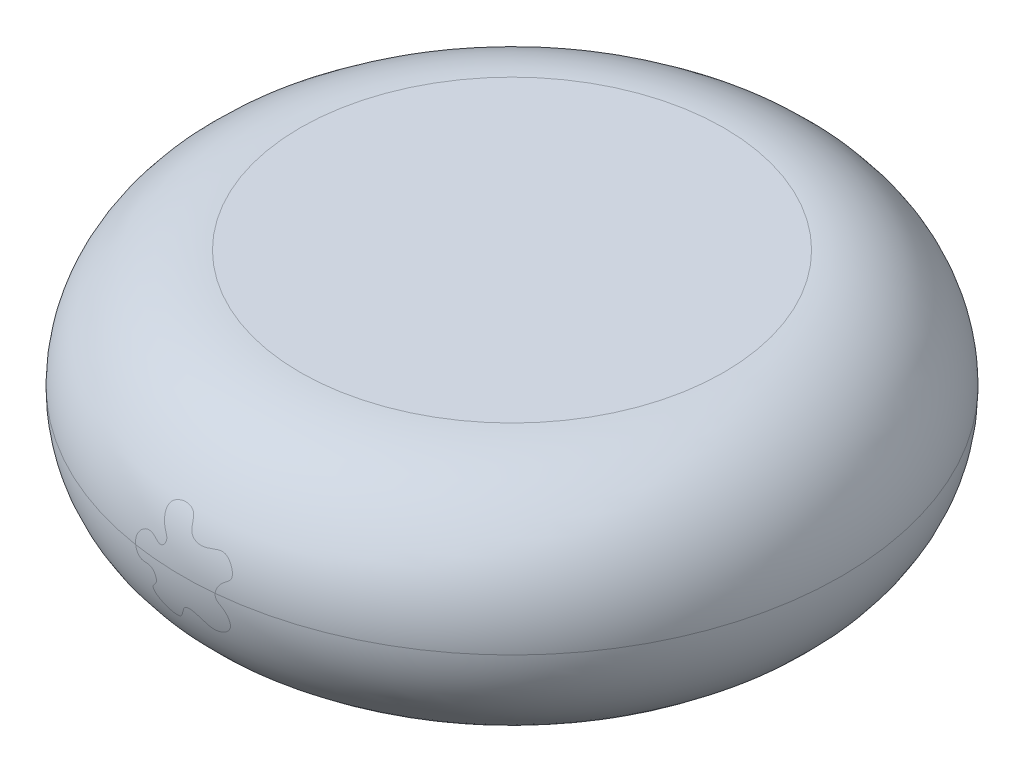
ISO-10303-21;
HEADER;
FILE_DESCRIPTION(('STEP AP214'),'2;1');
FILE_NAME('part.step','',(''),(''),'','','');
FILE_SCHEMA(('AUTOMOTIVE_DESIGN { 1 0 10303 214 1 1 1 1 }'));
ENDSEC;
DATA;
#1=APPLICATION_CONTEXT('core data for automotive mechanical design processes');
#2=APPLICATION_PROTOCOL_DEFINITION('international standard','automotive_design',2000,#1);
#3=PRODUCT_CONTEXT('',#1,'mechanical');
#4=PRODUCT('Part','Part','',(#3));
#5=PRODUCT_RELATED_PRODUCT_CATEGORY('part','',(#4));
#6=PRODUCT_DEFINITION_FORMATION('','',#4);
#7=PRODUCT_DEFINITION_CONTEXT('part definition',#1,'design');
#8=PRODUCT_DEFINITION('design','',#6,#7);
#9=PRODUCT_DEFINITION_SHAPE('','',#8);
#10=(LENGTH_UNIT() NAMED_UNIT(*) SI_UNIT(.MILLI.,.METRE.));
#11=(NAMED_UNIT(*) PLANE_ANGLE_UNIT() SI_UNIT($,.RADIAN.));
#12=(NAMED_UNIT(*) SI_UNIT($,.STERADIAN.) SOLID_ANGLE_UNIT());
#13=UNCERTAINTY_MEASURE_WITH_UNIT(LENGTH_MEASURE(1.E-05),#10,'distance_accuracy_value','');
#14=(GEOMETRIC_REPRESENTATION_CONTEXT(3) GLOBAL_UNCERTAINTY_ASSIGNED_CONTEXT((#13)) GLOBAL_UNIT_ASSIGNED_CONTEXT((#10,
#11,#12)) REPRESENTATION_CONTEXT('',''));
#15=CARTESIAN_POINT('',(0.,0.,0.));
#16=DIRECTION('',(0.,0.,1.));
#17=DIRECTION('',(1.,0.,0.));
#18=AXIS2_PLACEMENT_3D('',#15,#16,#17);
#19=CARTESIAN_POINT('',(0.,0.,0.));
#20=DIRECTION('',(0.,-1.,0.));
#21=DIRECTION('',(0.,0.,-1.));
#22=AXIS2_PLACEMENT_3D('',#19,#20,#21);
#23=TOROIDAL_SURFACE('',#22,22.5,12.5);
#24=CARTESIAN_POINT('',(0.,12.5,0.));
#25=DIRECTION('',(0.,-1.,0.));
#26=DIRECTION('',(0.,0.,-1.));
#27=AXIS2_PLACEMENT_3D('',#24,#25,#26);
#28=CIRCLE('',#27,22.5);
#29=CARTESIAN_POINT('',(0.,12.5,-22.5));
#30=VERTEX_POINT('',#29);
#31=EDGE_CURVE('E105',#30,#30,#28,.T.);
#32=ORIENTED_EDGE('',*,*,#31,.T.);
#33=EDGE_LOOP('',(#32));
#34=FACE_BOUND('',#33,.T.);
#35=CARTESIAN_POINT('',(0.,0.,0.));
#36=DIRECTION('',(0.,1.,0.));
#37=DIRECTION('',(-1.,0.,0.));
#38=AXIS2_PLACEMENT_3D('',#35,#36,#37);
#39=CIRCLE('',#38,35.);
#40=CARTESIAN_POINT('',(-5.38223294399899,0.,34.5836893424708));
#41=VERTEX_POINT('',#40);
#42=CARTESIAN_POINT('',(-35.,0.,0.));
#43=VERTEX_POINT('',#42);
#44=EDGE_CURVE('E94',#41,#43,#39,.F.);
#45=ORIENTED_EDGE('',*,*,#44,.F.);
#46=CARTESIAN_POINT('',(-5.38223294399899,0.,34.5836893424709));
#47=CARTESIAN_POINT('',(-5.39042226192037,0.0520202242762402,34.582417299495));
#48=CARTESIAN_POINT('',(-5.39639201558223,0.104385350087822,34.5811542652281));
#49=CARTESIAN_POINT('',(-5.40391310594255,0.209468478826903,34.5786432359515));
#50=CARTESIAN_POINT('',(-5.40546145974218,0.26218669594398,34.5773952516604));
#51=CARTESIAN_POINT('',(-5.40415241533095,0.367330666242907,34.5749186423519));
#52=CARTESIAN_POINT('',(-5.40131482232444,0.419756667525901,34.5736899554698));
#53=CARTESIAN_POINT('',(-5.39119131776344,0.524168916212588,34.5712769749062));
#54=CARTESIAN_POINT('',(-5.38390681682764,0.576155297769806,34.5700926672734));
#55=CARTESIAN_POINT('',(-5.36476175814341,0.678926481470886,34.5678396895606));
#56=CARTESIAN_POINT('',(-5.35293187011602,0.729716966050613,34.5667703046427));
#57=CARTESIAN_POINT('',(-5.32492166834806,0.830085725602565,34.5647479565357));
#58=CARTESIAN_POINT('',(-5.30874073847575,0.879663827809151,34.5637950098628));
#59=CARTESIAN_POINT('',(-5.27231730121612,0.977350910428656,34.562009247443));
#60=CARTESIAN_POINT('',(-5.25207165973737,1.02545872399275,34.5611765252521));
#61=CARTESIAN_POINT('',(-5.2077959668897,1.11988490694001,34.5596514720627));
#62=CARTESIAN_POINT('',(-5.18376558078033,1.16620311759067,34.5589591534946));
#63=CARTESIAN_POINT('',(-5.1059780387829,1.30275211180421,34.5571226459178));
#64=CARTESIAN_POINT('',(-5.04675045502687,1.38997934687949,34.5562303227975));
#65=CARTESIAN_POINT('',(-4.94833828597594,1.51293881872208,34.5556866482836));
#66=CARTESIAN_POINT('',(-4.91393527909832,1.55261522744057,34.5556379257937));
#67=CARTESIAN_POINT('',(-4.84198744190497,1.62913247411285,34.5558786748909));
#68=CARTESIAN_POINT('',(-4.80443808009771,1.66596907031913,34.5561686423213));
#69=CARTESIAN_POINT('',(-4.69966745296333,1.76044656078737,34.5575147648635));
#70=CARTESIAN_POINT('',(-4.62970447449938,1.81510223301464,34.5589590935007));
#71=CARTESIAN_POINT('',(-4.4821391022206,1.91265222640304,34.5635732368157));
#72=CARTESIAN_POINT('',(-4.40455364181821,1.95557185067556,34.5667392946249));
#73=CARTESIAN_POINT('',(-4.26270179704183,2.01775401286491,34.5743702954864));
#74=CARTESIAN_POINT('',(-4.19982413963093,2.0402357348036,34.5783275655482));
#75=CARTESIAN_POINT('',(-4.07127081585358,2.07488739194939,34.5878766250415));
#76=CARTESIAN_POINT('',(-4.00559516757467,2.08705739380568,34.5934684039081));
#77=CARTESIAN_POINT('',(-3.90605430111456,2.09629728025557,34.603222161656));
#78=CARTESIAN_POINT('',(-3.87250426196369,2.09785691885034,34.6067255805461));
#79=CARTESIAN_POINT('',(-3.80544285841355,2.09773281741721,34.6141852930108));
#80=CARTESIAN_POINT('',(-3.77193150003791,2.09604862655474,34.6181416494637));
#81=CARTESIAN_POINT('',(-3.70541499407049,2.08934672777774,34.626468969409));
#82=CARTESIAN_POINT('',(-3.67240850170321,2.08434050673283,34.6308384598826));
#83=CARTESIAN_POINT('',(-3.6071397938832,2.07100104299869,34.6399582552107));
#84=CARTESIAN_POINT('',(-3.57487717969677,2.06266962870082,34.6447083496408));
#85=CARTESIAN_POINT('',(-3.52834869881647,2.04809619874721,34.6519049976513));
#86=CARTESIAN_POINT('',(-3.51365979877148,2.04310896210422,34.6542292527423));
#87=CARTESIAN_POINT('',(-3.48454509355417,2.03244324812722,34.6589401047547));
#88=CARTESIAN_POINT('',(-3.47011928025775,2.02676479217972,34.6613266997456));
#89=CARTESIAN_POINT('',(-3.42723356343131,2.00880849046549,34.6685583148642));
#90=CARTESIAN_POINT('',(-3.39917078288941,1.99561144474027,34.673474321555));
#91=CARTESIAN_POINT('',(-3.34381439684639,1.96745453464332,34.6833983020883));
#92=CARTESIAN_POINT('',(-3.3165250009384,1.95248671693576,34.6884065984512));
#93=CARTESIAN_POINT('',(-3.26261158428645,1.92140931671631,34.6984151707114));
#94=CARTESIAN_POINT('',(-3.23598752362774,1.9052998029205,34.7034154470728));
#95=CARTESIAN_POINT('',(-3.144930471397,1.84861659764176,34.7205359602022));
#96=CARTESIAN_POINT('',(-3.0815284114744,1.80637052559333,34.7324901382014));
#97=CARTESIAN_POINT('',(-2.98535247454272,1.74477777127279,34.7496634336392));
#98=CARTESIAN_POINT('',(-2.95318674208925,1.72458527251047,34.7552501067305));
#99=CARTESIAN_POINT('',(-2.88783315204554,1.68572915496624,34.7661098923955));
#100=CARTESIAN_POINT('',(-2.85464470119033,1.66706644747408,34.7713828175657));
#101=CARTESIAN_POINT('',(-2.79458357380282,1.63678040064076,34.7803005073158));
#102=CARTESIAN_POINT('',(-2.768047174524,1.62453117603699,34.7840378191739));
#103=CARTESIAN_POINT('',(-2.71381883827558,1.60286518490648,34.7911396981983));
#104=CARTESIAN_POINT('',(-2.68612991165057,1.59344150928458,34.7945051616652));
#105=CARTESIAN_POINT('',(-2.63422537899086,1.58005470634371,34.8001871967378));
#106=CARTESIAN_POINT('',(-2.61019294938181,1.57544613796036,34.8025851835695));
#107=CARTESIAN_POINT('',(-2.56169636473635,1.57021066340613,34.8068542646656));
#108=CARTESIAN_POINT('',(-2.53723423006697,1.56956848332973,34.8087273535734));
#109=CARTESIAN_POINT('',(-2.48832521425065,1.5730406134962,34.8118169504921));
#110=CARTESIAN_POINT('',(-2.46388082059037,1.57720148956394,34.8130268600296));
#111=CARTESIAN_POINT('',(-2.41624534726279,1.59030299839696,34.8146879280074));
#112=CARTESIAN_POINT('',(-2.39305853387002,1.59925890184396,34.8151366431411));
#113=CARTESIAN_POINT('',(-2.3418409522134,1.62370411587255,34.8154419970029));
#114=CARTESIAN_POINT('',(-2.31437266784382,1.64033755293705,34.8150874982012));
#115=CARTESIAN_POINT('',(-2.26223348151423,1.67747949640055,34.8135309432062));
#116=CARTESIAN_POINT('',(-2.23756901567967,1.69799664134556,34.8123269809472));
#117=CARTESIAN_POINT('',(-2.17804070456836,1.7538793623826,34.8083344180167));
#118=CARTESIAN_POINT('',(-2.14504446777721,1.79119771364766,34.8050382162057));
#119=CARTESIAN_POINT('',(-2.08525196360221,1.87035272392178,34.7969323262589));
#120=CARTESIAN_POINT('',(-2.05846652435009,1.91219709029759,34.7921200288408));
#121=CARTESIAN_POINT('',(-2.01093466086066,2.0007265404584,34.7808515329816));
#122=CARTESIAN_POINT('',(-1.99039248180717,2.0475188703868,34.7743505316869));
#123=CARTESIAN_POINT('',(-1.96644155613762,2.11963328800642,34.7634275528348));
#124=CARTESIAN_POINT('',(-1.9596098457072,2.14393203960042,34.7596018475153));
#125=CARTESIAN_POINT('',(-1.94861141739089,2.19307044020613,34.7515505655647));
#126=CARTESIAN_POINT('',(-1.94444270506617,2.21790966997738,34.7473252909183));
#127=CARTESIAN_POINT('',(-1.94019930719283,2.2596348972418,34.7399403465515));
#128=CARTESIAN_POINT('',(-1.93922887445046,2.27644864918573,34.7368874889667));
#129=CARTESIAN_POINT('',(-1.93891558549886,2.31005416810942,34.7306235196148));
#130=CARTESIAN_POINT('',(-1.93957207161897,2.32684594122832,34.7274124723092));
#131=CARTESIAN_POINT('',(-1.94389005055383,2.37688110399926,34.7176057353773));
#132=CARTESIAN_POINT('',(-1.9498882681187,2.40990263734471,34.7108154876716));
#133=CARTESIAN_POINT('',(-1.96472803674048,2.46607994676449,34.6987694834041));
#134=CARTESIAN_POINT('',(-1.97243030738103,2.48957523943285,34.693571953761));
#135=CARTESIAN_POINT('',(-1.98996872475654,2.53573601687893,34.6830825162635));
#136=CARTESIAN_POINT('',(-1.99980572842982,2.55840116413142,34.6777905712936));
#137=CARTESIAN_POINT('',(-2.02114450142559,2.60320742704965,34.6670833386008));
#138=CARTESIAN_POINT('',(-2.03266341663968,2.62534001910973,34.6616673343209));
#139=CARTESIAN_POINT('',(-2.05677477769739,2.66899868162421,34.6507679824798));
#140=CARTESIAN_POINT('',(-2.06936764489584,2.69052450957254,34.645284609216));
#141=CARTESIAN_POINT('',(-2.09930409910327,2.73992722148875,34.632486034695));
#142=CARTESIAN_POINT('',(-2.11688633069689,2.76765002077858,34.6251421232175));
#143=CARTESIAN_POINT('',(-2.15239568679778,2.82282790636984,34.6102690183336));
#144=CARTESIAN_POINT('',(-2.17032289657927,2.85028292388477,34.6027397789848));
#145=CARTESIAN_POINT('',(-2.20586209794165,2.90530155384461,34.5874497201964));
#146=CARTESIAN_POINT('',(-2.22347434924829,2.93286505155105,34.5796891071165));
#147=CARTESIAN_POINT('',(-2.2577417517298,2.98849507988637,34.5638774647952));
#148=CARTESIAN_POINT('',(-2.27439711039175,3.01656149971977,34.5558264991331));
#149=CARTESIAN_POINT('',(-2.30666929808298,3.07317551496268,34.5394366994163));
#150=CARTESIAN_POINT('',(-2.32228682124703,3.10172277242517,34.5310980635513));
#151=CARTESIAN_POINT('',(-2.35251927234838,3.15926357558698,34.5141322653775));
#152=CARTESIAN_POINT('',(-2.36713403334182,3.18825719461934,34.5055050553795));
#153=CARTESIAN_POINT('',(-2.40907014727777,3.27504921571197,34.4794362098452));
#154=CARTESIAN_POINT('',(-2.43492706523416,3.33344008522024,34.4615815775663));
#155=CARTESIAN_POINT('',(-2.48262273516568,3.45168286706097,34.4247497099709));
#156=CARTESIAN_POINT('',(-2.50445077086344,3.51153820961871,34.4057696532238));
#157=CARTESIAN_POINT('',(-2.54375554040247,3.63232838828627,34.3667692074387));
#158=CARTESIAN_POINT('',(-2.56123298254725,3.69326304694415,34.346748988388));
#159=CARTESIAN_POINT('',(-2.58805601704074,3.80214066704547,34.3103527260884));
#160=CARTESIAN_POINT('',(-2.59834656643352,3.84991716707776,34.2941720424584));
#161=CARTESIAN_POINT('',(-2.61585167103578,3.94580104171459,34.2612810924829));
#162=CARTESIAN_POINT('',(-2.62306927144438,3.99390804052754,34.2445713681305));
#163=CARTESIAN_POINT('',(-2.63418609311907,4.09060130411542,34.2105771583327));
#164=CARTESIAN_POINT('',(-2.63806755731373,4.13918875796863,34.1932900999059));
#165=CARTESIAN_POINT('',(-2.64209399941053,4.23638122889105,34.1583175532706));
#166=CARTESIAN_POINT('',(-2.64223837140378,4.2849862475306,34.1406320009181));
#167=CARTESIAN_POINT('',(-2.6371042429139,4.41403532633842,34.0931889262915));
#168=CARTESIAN_POINT('',(-2.6281788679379,4.49429261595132,34.0631775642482));
#169=CARTESIAN_POINT('',(-2.59672122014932,4.65203168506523,34.0033976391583));
#170=CARTESIAN_POINT('',(-2.57423682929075,4.72952221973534,33.9736285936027));
#171=CARTESIAN_POINT('',(-2.52018783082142,4.86312089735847,33.9219059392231));
#172=CARTESIAN_POINT('',(-2.49155433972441,4.92028209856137,33.8996322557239));
#173=CARTESIAN_POINT('',(-2.42432730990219,5.02926341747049,33.8571060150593));
#174=CARTESIAN_POINT('',(-2.38574770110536,5.08109086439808,33.8368506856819));
#175=CARTESIAN_POINT('',(-2.3209926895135,5.15336887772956,33.8087364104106));
#176=CARTESIAN_POINT('',(-2.29826799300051,5.1765448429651,33.7997454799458));
#177=CARTESIAN_POINT('',(-2.25082093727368,5.22106996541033,33.7825300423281));
#178=CARTESIAN_POINT('',(-2.22609823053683,5.24241880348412,33.774305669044));
#179=CARTESIAN_POINT('',(-2.14935334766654,5.30385765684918,33.7507283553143));
#180=CARTESIAN_POINT('',(-2.09482618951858,5.3412624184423,33.7365014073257));
#181=CARTESIAN_POINT('',(-1.95196668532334,5.42690709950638,33.7042676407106));
#182=CARTESIAN_POINT('',(-1.86066678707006,5.47083105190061,33.6880778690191));
#183=CARTESIAN_POINT('',(-1.67184733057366,5.5449945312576,33.6615280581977));
#184=CARTESIAN_POINT('',(-1.57431586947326,5.57520691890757,33.6511795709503));
#185=CARTESIAN_POINT('',(-1.37254221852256,5.62323567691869,33.6359414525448));
#186=CARTESIAN_POINT('',(-1.2681852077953,5.64062593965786,33.6312364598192));
#187=CARTESIAN_POINT('',(-1.05803242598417,5.66071938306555,33.6283153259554));
#188=CARTESIAN_POINT('',(-0.95223949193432,5.66344820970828,33.6300878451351));
#189=CARTESIAN_POINT('',(-0.776704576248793,5.65377216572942,33.6394208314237));
#190=CARTESIAN_POINT('',(-0.706588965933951,5.64606516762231,33.6448777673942));
#191=CARTESIAN_POINT('',(-0.568321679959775,5.6216833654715,33.6598098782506));
#192=CARTESIAN_POINT('',(-0.500167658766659,5.60501978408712,33.6692800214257));
#193=CARTESIAN_POINT('',(-0.384940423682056,5.56659693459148,33.6899472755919));
#194=CARTESIAN_POINT('',(-0.336902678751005,5.54719998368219,33.7000981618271));
#195=CARTESIAN_POINT('',(-0.244855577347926,5.5017090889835,33.7233058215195));
#196=CARTESIAN_POINT('',(-0.200840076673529,5.47562559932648,33.7363580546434));
#197=CARTESIAN_POINT('',(-0.12578099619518,5.42127427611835,33.7630210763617));
#198=CARTESIAN_POINT('',(-0.0937984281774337,5.39409724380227,33.7761752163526));
#199=CARTESIAN_POINT('',(-0.0500997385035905,5.34986338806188,33.7972766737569));
#200=CARTESIAN_POINT('',(-0.0362531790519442,5.33455111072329,33.8045340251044));
#201=CARTESIAN_POINT('',(-0.0101250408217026,5.30283105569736,33.8194660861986));
#202=CARTESIAN_POINT('',(0.0021566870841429,5.28642338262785,33.8271407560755));
#203=CARTESIAN_POINT('',(0.0285057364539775,5.24767742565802,33.8451427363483));
#204=CARTESIAN_POINT('',(0.042026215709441,5.22502077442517,33.8555830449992));
#205=CARTESIAN_POINT('',(0.0667135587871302,5.17859934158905,33.8767885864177));
#206=CARTESIAN_POINT('',(0.0778783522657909,5.15483360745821,33.8875540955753));
#207=CARTESIAN_POINT('',(0.0982671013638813,5.10641369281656,33.9092959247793));
#208=CARTESIAN_POINT('',(0.107480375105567,5.08175544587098,33.9202730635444));
#209=CARTESIAN_POINT('',(0.124259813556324,5.03192431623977,33.94225936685));
#210=CARTESIAN_POINT('',(0.13182679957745,5.0067516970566,33.9532685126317));
#211=CARTESIAN_POINT('',(0.156092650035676,4.91791978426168,33.9917669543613));
#212=CARTESIAN_POINT('',(0.169412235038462,4.85330915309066,34.0191432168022));
#213=CARTESIAN_POINT('',(0.19232342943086,4.72303704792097,34.0730463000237));
#214=CARTESIAN_POINT('',(0.201907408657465,4.65737370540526,34.099571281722));
#215=CARTESIAN_POINT('',(0.220644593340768,4.52551664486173,34.1515297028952));
#216=CARTESIAN_POINT('',(0.229797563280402,4.45932265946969,34.1769625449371));
#217=CARTESIAN_POINT('',(0.250873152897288,4.32694025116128,34.2265101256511));
#218=CARTESIAN_POINT('',(0.262790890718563,4.26075202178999,34.2506270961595));
#219=CARTESIAN_POINT('',(0.284442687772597,4.16755668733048,34.2836551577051));
#220=CARTESIAN_POINT('',(0.291410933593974,4.14016535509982,34.2932471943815));
#221=CARTESIAN_POINT('',(0.306886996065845,4.08568094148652,34.312097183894));
#222=CARTESIAN_POINT('',(0.315395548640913,4.05858800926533,34.3213549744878));
#223=CARTESIAN_POINT('',(0.334294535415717,4.00505800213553,34.3394174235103));
#224=CARTESIAN_POINT('',(0.344676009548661,3.97861845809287,34.3482239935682));
#225=CARTESIAN_POINT('',(0.367736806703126,3.9265937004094,34.3653261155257));
#226=CARTESIAN_POINT('',(0.380414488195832,3.90100789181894,34.3736220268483));
#227=CARTESIAN_POINT('',(0.406079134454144,3.85539410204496,34.3882061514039));
#228=CARTESIAN_POINT('',(0.418644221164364,3.83516270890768,34.3945954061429));
#229=CARTESIAN_POINT('',(0.445659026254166,3.79583801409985,34.4068621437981));
#230=CARTESIAN_POINT('',(0.460108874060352,3.77674479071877,34.4127395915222));
#231=CARTESIAN_POINT('',(0.506032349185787,3.72127728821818,34.4295927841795));
#232=CARTESIAN_POINT('',(0.540060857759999,3.68674869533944,34.4397787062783));
#233=CARTESIAN_POINT('',(0.621665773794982,3.61583470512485,34.4600988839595));
#234=CARTESIAN_POINT('',(0.670560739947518,3.58083083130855,34.4696884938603));
#235=CARTESIAN_POINT('',(0.773576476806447,3.51862188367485,34.4859599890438));
#236=CARTESIAN_POINT('',(0.827711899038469,3.49143957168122,34.4926334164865));
#237=CARTESIAN_POINT('',(0.962886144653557,3.43420890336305,34.5057037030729));
#238=CARTESIAN_POINT('',(1.04560612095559,3.40782531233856,34.5107855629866));
#239=CARTESIAN_POINT('',(1.17180034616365,3.37774325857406,34.5151284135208));
#240=CARTESIAN_POINT('',(1.21421431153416,3.36929839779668,34.5160294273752));
#241=CARTESIAN_POINT('',(1.29954633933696,3.35540129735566,34.5168060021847));
#242=CARTESIAN_POINT('',(1.34246434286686,3.34994871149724,34.5166816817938));
#243=CARTESIAN_POINT('',(1.44271590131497,3.34059445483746,34.5152583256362));
#244=CARTESIAN_POINT('',(1.50014884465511,3.33779242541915,34.513586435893));
#245=CARTESIAN_POINT('',(1.61497692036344,3.33728200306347,34.5085455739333));
#246=CARTESIAN_POINT('',(1.67237202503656,3.33957584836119,34.5051758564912));
#247=CARTESIAN_POINT('',(1.78709678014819,3.34862734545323,34.496908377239));
#248=CARTESIAN_POINT('',(1.84442290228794,3.35541742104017,34.4919996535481));
#249=CARTESIAN_POINT('',(1.95835319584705,3.37248663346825,34.4809412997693));
#250=CARTESIAN_POINT('',(2.01495800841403,3.38276240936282,34.4747928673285));
#251=CARTESIAN_POINT('',(2.15159556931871,3.41081838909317,34.4586516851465));
#252=CARTESIAN_POINT('',(2.23128608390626,3.42992811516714,34.4481398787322));
#253=CARTESIAN_POINT('',(2.38988884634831,3.47077894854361,34.4257404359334));
#254=CARTESIAN_POINT('',(2.46879966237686,3.49252417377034,34.4138506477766));
#255=CARTESIAN_POINT('',(2.62699765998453,3.53619040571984,34.3893076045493));
#256=CARTESIAN_POINT('',(2.70628406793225,3.55811165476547,34.3766499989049));
#257=CARTESIAN_POINT('',(2.86383096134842,3.59861457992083,34.351735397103));
#258=CARTESIAN_POINT('',(2.94207296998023,3.61726158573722,34.3394758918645));
#259=CARTESIAN_POINT('',(3.06031240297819,3.64048388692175,34.3219898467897));
#260=CARTESIAN_POINT('',(3.0997608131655,3.64742053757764,34.3163261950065));
#261=CARTESIAN_POINT('',(3.17902728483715,3.65919254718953,34.3054607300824));
#262=CARTESIAN_POINT('',(3.21884542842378,3.66402742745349,34.3002590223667));
#263=CARTESIAN_POINT('',(3.33821212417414,3.67437393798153,34.285727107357));
#264=CARTESIAN_POINT('',(3.41839122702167,3.67589069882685,34.2773568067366));
#265=CARTESIAN_POINT('',(3.53112926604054,3.666820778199,34.268648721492));
#266=CARTESIAN_POINT('',(3.56409737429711,3.66279762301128,34.2664767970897));
#267=CARTESIAN_POINT('',(3.62962612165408,3.65175046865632,34.2629968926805));
#268=CARTESIAN_POINT('',(3.6621862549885,3.64472306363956,34.261689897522));
#269=CARTESIAN_POINT('',(3.72649054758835,3.62752169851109,34.2600160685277));
#270=CARTESIAN_POINT('',(3.75823477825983,3.61734801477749,34.259649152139));
#271=CARTESIAN_POINT('',(3.82056025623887,3.59390185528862,34.2598619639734));
#272=CARTESIAN_POINT('',(3.8511412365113,3.5806286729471,34.2604419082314));
#273=CARTESIAN_POINT('',(3.94005335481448,3.53671580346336,34.263523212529));
#274=CARTESIAN_POINT('',(3.99623534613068,3.50179761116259,34.2673499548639));
#275=CARTESIAN_POINT('',(4.10296486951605,3.42425472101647,34.2772542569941));
#276=CARTESIAN_POINT('',(4.15348048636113,3.38158960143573,34.2833438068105));
#277=CARTESIAN_POINT('',(4.24071135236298,3.29887695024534,34.2957345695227));
#278=CARTESIAN_POINT('',(4.27828973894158,3.25969328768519,34.3018093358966));
#279=CARTESIAN_POINT('',(4.34997557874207,3.17834267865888,34.3146467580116));
#280=CARTESIAN_POINT('',(4.38408073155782,3.13617378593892,34.3214098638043));
#281=CARTESIAN_POINT('',(4.44881699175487,3.04934648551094,34.3354362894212));
#282=CARTESIAN_POINT('',(4.47944900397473,3.00468873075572,34.3426994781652));
#283=CARTESIAN_POINT('',(4.53709160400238,2.91320270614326,34.3576152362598));
#284=CARTESIAN_POINT('',(4.56410387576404,2.86637545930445,34.3652676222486));
#285=CARTESIAN_POINT('',(4.62694120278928,2.74648980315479,34.3848700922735));
#286=CARTESIAN_POINT('',(4.66031951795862,2.67213634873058,34.3970374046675));
#287=CARTESIAN_POINT('',(4.7020683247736,2.55780542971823,34.4158463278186));
#288=CARTESIAN_POINT('',(4.71458937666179,2.51927013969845,34.4222020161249));
#289=CARTESIAN_POINT('',(4.73640321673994,2.44133990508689,34.4351325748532));
#290=CARTESIAN_POINT('',(4.74569801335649,2.40194551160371,34.441707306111));
#291=CARTESIAN_POINT('',(4.76132233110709,2.3176664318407,34.4559241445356));
#292=CARTESIAN_POINT('',(4.76715920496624,2.27269246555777,34.4635993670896));
#293=CARTESIAN_POINT('',(4.77272266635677,2.18235769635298,34.4793445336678));
#294=CARTESIAN_POINT('',(4.77244948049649,2.13699690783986,34.4874144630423));
#295=CARTESIAN_POINT('',(4.76495261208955,2.05604613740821,34.5023234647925));
#296=CARTESIAN_POINT('',(4.75913336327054,2.02032047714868,34.5090849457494));
#297=CARTESIAN_POINT('',(4.74161920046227,1.95047653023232,34.5228364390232));
#298=CARTESIAN_POINT('',(4.72995031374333,1.91635184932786,34.5298253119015));
#299=CARTESIAN_POINT('',(4.70017089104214,1.85098125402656,34.543948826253));
#300=CARTESIAN_POINT('',(4.68204749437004,1.81974124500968,34.5510837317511));
#301=CARTESIAN_POINT('',(4.65131265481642,1.77534639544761,34.5617121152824));
#302=CARTESIAN_POINT('',(4.64044578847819,1.76092744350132,34.5652509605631));
#303=CARTESIAN_POINT('',(4.61774794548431,1.73286774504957,34.5722859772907));
#304=CARTESIAN_POINT('',(4.60591748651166,1.71922658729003,34.5757821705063));
#305=CARTESIAN_POINT('',(4.57174338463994,1.68204558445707,34.5854893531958));
#306=CARTESIAN_POINT('',(4.54853895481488,1.65928630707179,34.591642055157));
#307=CARTESIAN_POINT('',(4.5005290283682,1.61545653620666,34.6037610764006));
#308=CARTESIAN_POINT('',(4.47572169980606,1.59438803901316,34.6097271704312));
#309=CARTESIAN_POINT('',(4.42504828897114,1.55330988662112,34.6214987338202));
#310=CARTESIAN_POINT('',(4.39917833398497,1.53330485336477,34.6273034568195));
#311=CARTESIAN_POINT('',(4.34691850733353,1.49393169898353,34.6387432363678));
#312=CARTESIAN_POINT('',(4.32052850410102,1.47456374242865,34.644378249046));
#313=CARTESIAN_POINT('',(4.24082043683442,1.4165271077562,34.6611120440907));
#314=CARTESIAN_POINT('',(4.18724728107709,1.37813833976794,34.6719760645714));
#315=CARTESIAN_POINT('',(4.10813046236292,1.31892577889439,34.6878295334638));
#316=CARTESIAN_POINT('',(4.08200428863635,1.29894842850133,34.6930326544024));
#317=CARTESIAN_POINT('',(4.03039828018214,1.25814018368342,34.7032901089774));
#318=CARTESIAN_POINT('',(4.00491835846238,1.23730940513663,34.7083444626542));
#319=CARTESIAN_POINT('',(3.95461351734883,1.19425997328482,34.7183469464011));
#320=CARTESIAN_POINT('',(3.92979930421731,1.1720282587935,34.7232932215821));
#321=CARTESIAN_POINT('',(3.88140585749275,1.12621568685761,34.7329916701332));
#322=CARTESIAN_POINT('',(3.85782667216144,1.10263477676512,34.7377438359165));
#323=CARTESIAN_POINT('',(3.81185243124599,1.05424776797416,34.7470342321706));
#324=CARTESIAN_POINT('',(3.78945896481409,1.02944010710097,34.7515721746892));
#325=CARTESIAN_POINT('',(3.74590856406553,0.978721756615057,34.76040441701));
#326=CARTESIAN_POINT('',(3.72475171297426,0.952810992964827,34.7646987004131));
#327=CARTESIAN_POINT('',(3.66316497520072,0.873558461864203,34.7771829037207));
#328=CARTESIAN_POINT('',(3.62460520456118,0.818681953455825,34.7849769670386));
#329=CARTESIAN_POINT('',(3.55283441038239,0.705393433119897,34.7993360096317));
#330=CARTESIAN_POINT('',(3.51962281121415,0.646981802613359,34.8059011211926));
#331=CARTESIAN_POINT('',(3.46630845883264,0.541185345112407,34.8162438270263));
#332=CARTESIAN_POINT('',(3.44496226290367,0.494454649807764,34.8203135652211));
#333=CARTESIAN_POINT('',(3.40620397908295,0.399373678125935,34.8275439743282));
#334=CARTESIAN_POINT('',(3.38878734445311,0.351025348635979,34.8307056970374));
#335=CARTESIAN_POINT('',(3.35848789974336,0.252929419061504,34.8360212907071));
#336=CARTESIAN_POINT('',(3.34559765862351,0.203184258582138,34.8381768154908));
#337=CARTESIAN_POINT('',(3.33026144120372,0.127653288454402,34.840573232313));
#338=CARTESIAN_POINT('',(3.32581183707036,0.102281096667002,34.8412329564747));
#339=CARTESIAN_POINT('',(3.31839615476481,0.051299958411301,34.8422547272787));
#340=CARTESIAN_POINT('',(3.31543100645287,0.0256908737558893,34.8426165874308));
#341=CARTESIAN_POINT('',(3.31327890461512,0.,34.8428211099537));
#342=B_SPLINE_CURVE_WITH_KNOTS('',3,(#46,#47,#48,#49,#50,#51,#52,#53,#54,#55,#56,#57,#58,#59,
#60,#61,#62,#63,#64,#65,#66,#67,#68,#69,#70,#71,#72,#73,#74,#75,#76,#77,#78,#79,#80,#81,#82,#83,
#84,#85,#86,#87,#88,#89,#90,#91,#92,#93,#94,#95,#96,#97,#98,#99,#100,#101,#102,#103,#104,#105,
#106,#107,#108,#109,#110,#111,#112,#113,#114,#115,#116,#117,#118,#119,#120,#121,#122,#123,#124,
#125,#126,#127,#128,#129,#130,#131,#132,#133,#134,#135,#136,#137,#138,#139,#140,#141,#142,#143,
#144,#145,#146,#147,#148,#149,#150,#151,#152,#153,#154,#155,#156,#157,#158,#159,#160,#161,#162,
#163,#164,#165,#166,#167,#168,#169,#170,#171,#172,#173,#174,#175,#176,#177,#178,#179,#180,#181,
#182,#183,#184,#185,#186,#187,#188,#189,#190,#191,#192,#193,#194,#195,#196,#197,#198,#199,#200,
#201,#202,#203,#204,#205,#206,#207,#208,#209,#210,#211,#212,#213,#214,#215,#216,#217,#218,#219,
#220,#221,#222,#223,#224,#225,#226,#227,#228,#229,#230,#231,#232,#233,#234,#235,#236,#237,#238,
#239,#240,#241,#242,#243,#244,#245,#246,#247,#248,#249,#250,#251,#252,#253,#254,#255,#256,#257,
#258,#259,#260,#261,#262,#263,#264,#265,#266,#267,#268,#269,#270,#271,#272,#273,#274,#275,#276,
#277,#278,#279,#280,#281,#282,#283,#284,#285,#286,#287,#288,#289,#290,#291,#292,#293,#294,#295,
#296,#297,#298,#299,#300,#301,#302,#303,#304,#305,#306,#307,#308,#309,#310,#311,#312,#313,#314,
#315,#316,#317,#318,#319,#320,#321,#322,#323,#324,#325,#326,#327,#328,#329,#330,#331,#332,#333,
#334,#335,#336,#337,#338,#339,#340,#341),.UNSPECIFIED.,.F.,.F.,(4,2,2,2,2,2,2,2,2,2,2,2,2,2,2,2,
2,2,2,2,2,2,2,2,2,2,2,2,2,2,2,2,2,2,2,2,2,2,2,2,2,2,2,2,2,2,2,2,2,2,2,2,2,2,2,2,2,2,2,2,2,2,2,2,
2,2,2,2,2,2,2,2,2,2,2,2,2,2,2,2,2,2,2,2,2,2,2,2,2,2,2,2,2,2,2,2,2,2,2,2,2,2,2,2,2,2,2,2,2,2,2,2,
2,2,2,2,2,2,2,2,2,2,2,2,2,2,2,2,2,2,2,2,2,2,2,2,2,2,2,2,2,2,2,2,2,2,2,4),(0.,0.157974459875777,
0.316055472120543,0.473424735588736,0.630744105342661,0.787020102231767,0.943318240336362,
1.09973735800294,1.25617031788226,1.57093400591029,1.72834652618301,1.88598978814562,
2.15136047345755,2.41615442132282,2.6161292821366,2.81610285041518,2.91727551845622,
3.01846224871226,3.11930090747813,3.22008419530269,3.26712676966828,3.31416788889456,
3.40826726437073,3.50280658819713,3.59734022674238,3.82865140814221,3.94380293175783,
4.05902255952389,4.14731957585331,4.23539889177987,4.30890720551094,4.38213227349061,
4.45607326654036,4.53025115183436,4.6260882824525,4.72214114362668,4.87111522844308,
5.02034711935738,5.17403581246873,5.25051532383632,5.32693748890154,5.37821461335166,
5.4294710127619,5.53162744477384,5.60731693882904,5.68303687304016,5.75959096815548,
5.83617523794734,5.93708136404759,6.03801276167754,6.13885668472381,6.23967865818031,
6.34043250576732,6.44120308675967,6.63997045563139,6.83925913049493,7.03851533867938,
7.19287303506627,7.34707740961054,7.50209756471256,7.65714285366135,7.91465309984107,
8.1712592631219,8.37352598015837,8.57551093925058,8.67644243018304,8.77739151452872,
8.97961570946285,9.28580546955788,9.59259865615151,9.90917705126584,10.2252015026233,
10.4369160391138,10.6483659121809,10.8062175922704,10.9638239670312,11.095130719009,
11.1607041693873,11.2262713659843,11.3112381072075,11.3962792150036,11.4817744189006,
11.567226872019,11.7811808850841,11.9955696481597,12.2100742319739,12.4242029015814,
12.5137106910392,12.6032613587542,12.6923944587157,12.7814640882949,12.855335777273,
12.9292125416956,13.0770843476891,13.2587765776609,13.4409923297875,13.7004065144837,
13.8300947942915,13.9597680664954,14.1320835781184,14.3044747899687,14.4781229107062,
14.6516040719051,14.8993372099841,15.1474625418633,15.3971561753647,15.6410944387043,
15.7623914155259,15.8837160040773,16.1241407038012,16.2238683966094,16.3237094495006,
16.4235417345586,16.5233968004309,16.7210301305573,16.9197259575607,17.0834037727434,
17.2471893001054,17.4109320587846,17.5745983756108,17.8209904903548,17.9439293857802,
18.0667916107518,18.2044674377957,18.3421381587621,18.4522082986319,18.561792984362,
18.6715972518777,18.7267640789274,18.7819014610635,18.8810058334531,18.9802255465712,
19.0798461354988,19.1794922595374,19.3798632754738,19.479744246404,19.5796117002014,
19.6806118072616,19.7816158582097,19.8827520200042,19.9838949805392,20.1861207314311,
20.3883247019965,20.5427698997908,20.6970354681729,20.8510465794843,20.92830977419,
21.005621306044),.UNSPECIFIED.);
#343=CARTESIAN_POINT('',(3.31327890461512,0.,34.8428211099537));
#344=VERTEX_POINT('',#343);
#345=EDGE_CURVE('E11',#41,#344,#342,.T.);
#346=ORIENTED_EDGE('',*,*,#345,.T.);
#347=CARTESIAN_POINT('',(35.,0.,0.));
#348=VERTEX_POINT('',#347);
#349=EDGE_CURVE('E77',#348,#344,#39,.F.);
#350=ORIENTED_EDGE('',*,*,#349,.F.);
#351=CARTESIAN_POINT('',(3.31327890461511,0.,-34.8428211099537));
#352=VERTEX_POINT('',#351);
#353=EDGE_CURVE('E73',#352,#348,#39,.F.);
#354=ORIENTED_EDGE('',*,*,#353,.F.);
#355=CARTESIAN_POINT('',(3.31327890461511,0.,-34.8428211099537));
#356=CARTESIAN_POINT('',(3.31669772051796,0.0406322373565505,-34.8424970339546));
#357=CARTESIAN_POINT('',(3.32212400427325,0.081045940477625,-34.8417805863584));
#358=CARTESIAN_POINT('',(3.33648654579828,0.161152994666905,-34.8396276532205));
#359=CARTESIAN_POINT('',(3.34541613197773,0.200847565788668,-34.8381925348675));
#360=CARTESIAN_POINT('',(3.36631477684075,0.279455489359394,-34.8346622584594));
#361=CARTESIAN_POINT('',(3.37828898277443,0.31836739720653,-34.832565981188));
#362=CARTESIAN_POINT('',(3.40492288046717,0.395244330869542,-34.8277668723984));
#363=CARTESIAN_POINT('',(3.41958434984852,0.433208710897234,-34.8250636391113));
#364=CARTESIAN_POINT('',(3.45757089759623,0.522852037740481,-34.8179219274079));
#365=CARTESIAN_POINT('',(3.48203158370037,0.574030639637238,-34.813219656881));
#366=CARTESIAN_POINT('',(3.53508825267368,0.674098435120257,-34.802844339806));
#367=CARTESIAN_POINT('',(3.56368549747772,0.722986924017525,-34.7971709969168));
#368=CARTESIAN_POINT('',(3.62462446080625,0.818155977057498,-34.7849660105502));
#369=CARTESIAN_POINT('',(3.65696067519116,0.864440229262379,-34.778435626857));
#370=CARTESIAN_POINT('',(3.72519765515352,0.954153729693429,-34.7646118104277));
#371=CARTESIAN_POINT('',(3.76109691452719,0.997584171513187,-34.7573187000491));
#372=CARTESIAN_POINT('',(3.82888929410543,1.07290338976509,-34.7435856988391));
#373=CARTESIAN_POINT('',(3.86016224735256,1.10537144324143,-34.7372639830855));
#374=CARTESIAN_POINT('',(3.90874377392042,1.15227083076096,-34.7275099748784));
#375=CARTESIAN_POINT('',(3.9252156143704,1.16760294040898,-34.7242135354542));
#376=CARTESIAN_POINT('',(3.95867601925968,1.19767495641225,-34.7175383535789));
#377=CARTESIAN_POINT('',(3.97566461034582,1.212414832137,-34.7141596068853));
#378=CARTESIAN_POINT('',(4.02728564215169,1.25590953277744,-34.7039035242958));
#379=CARTESIAN_POINT('',(4.06253521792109,1.28390334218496,-34.696913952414));
#380=CARTESIAN_POINT('',(4.13397751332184,1.33858034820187,-34.6826663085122));
#381=CARTESIAN_POINT('',(4.17017046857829,1.36526321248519,-34.6754081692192));
#382=CARTESIAN_POINT('',(4.23589745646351,1.41314188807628,-34.6620295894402));
#383=CARTESIAN_POINT('',(4.26538591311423,1.43441422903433,-34.6559559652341));
#384=CARTESIAN_POINT('',(4.32415525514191,1.47720371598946,-34.6436156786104));
#385=CARTESIAN_POINT('',(4.35343609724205,1.49872091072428,-34.6373489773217));
#386=CARTESIAN_POINT('',(4.41129825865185,1.54260362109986,-34.624605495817));
#387=CARTESIAN_POINT('',(4.43987992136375,1.56496870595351,-34.6181288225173));
#388=CARTESIAN_POINT('',(4.49568082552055,1.61125058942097,-34.6049485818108));
#389=CARTESIAN_POINT('',(4.52290108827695,1.63516619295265,-34.5982451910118));
#390=CARTESIAN_POINT('',(4.57762196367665,1.68785541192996,-34.5839273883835));
#391=CARTESIAN_POINT('',(4.60488952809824,1.71687539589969,-34.5762880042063));
#392=CARTESIAN_POINT('',(4.64221364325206,1.76316303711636,-34.5646943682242));
#393=CARTESIAN_POINT('',(4.65403930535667,1.77901843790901,-34.560815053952));
#394=CARTESIAN_POINT('',(4.67623598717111,1.81171144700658,-34.553030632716));
#395=CARTESIAN_POINT('',(4.68660758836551,1.82854865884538,-34.5491255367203));
#396=CARTESIAN_POINT('',(4.70573192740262,1.86344039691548,-34.5412682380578));
#397=CARTESIAN_POINT('',(4.71445961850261,1.88150880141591,-34.5373161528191));
#398=CARTESIAN_POINT('',(4.72991791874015,1.91849244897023,-34.5294617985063));
#399=CARTESIAN_POINT('',(4.73664812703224,1.93740786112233,-34.5255595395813));
#400=CARTESIAN_POINT('',(4.74825117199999,1.97588187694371,-34.5178108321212));
#401=CARTESIAN_POINT('',(4.75311719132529,1.99544256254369,-34.5139646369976));
#402=CARTESIAN_POINT('',(4.76109046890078,2.03493177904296,-34.5063540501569));
#403=CARTESIAN_POINT('',(4.76419727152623,2.05486040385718,-34.5025896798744));
#404=CARTESIAN_POINT('',(4.77242969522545,2.12629388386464,-34.489313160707));
#405=CARTESIAN_POINT('',(4.77309802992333,2.17837595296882,-34.480031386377));
#406=CARTESIAN_POINT('',(4.7664453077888,2.28205050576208,-34.4619758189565));
#407=CARTESIAN_POINT('',(4.75910791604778,2.33364177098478,-34.4532031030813));
#408=CARTESIAN_POINT('',(4.7398549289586,2.42794119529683,-34.4373580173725));
#409=CARTESIAN_POINT('',(4.72879168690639,2.4708204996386,-34.4302280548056));
#410=CARTESIAN_POINT('',(4.70298599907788,2.55551616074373,-34.4162178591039));
#411=CARTESIAN_POINT('',(4.68824105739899,2.59733177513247,-34.4093377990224));
#412=CARTESIAN_POINT('',(4.65560000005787,2.67979337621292,-34.3957995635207));
#413=CARTESIAN_POINT('',(4.63770055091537,2.72043807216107,-34.3891416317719));
#414=CARTESIAN_POINT('',(4.59912202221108,2.80042542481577,-34.3760499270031));
#415=CARTESIAN_POINT('',(4.57844249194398,2.83976786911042,-34.3696161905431));
#416=CARTESIAN_POINT('',(4.53297819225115,2.91980193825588,-34.3565402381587));
#417=CARTESIAN_POINT('',(4.50800589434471,2.96038992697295,-34.3499158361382));
#418=CARTESIAN_POINT('',(4.4553234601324,3.03978023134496,-34.3369962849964));
#419=CARTESIAN_POINT('',(4.42761430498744,3.07858317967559,-34.3307010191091));
#420=CARTESIAN_POINT('',(4.36950257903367,3.15420772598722,-34.3185196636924));
#421=CARTESIAN_POINT('',(4.33909944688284,3.19102890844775,-34.3126336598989));
#422=CARTESIAN_POINT('',(4.27559773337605,3.26232282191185,-34.301408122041));
#423=CARTESIAN_POINT('',(4.24250025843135,3.29679650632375,-34.2960683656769));
#424=CARTESIAN_POINT('',(4.16156456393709,3.37436440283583,-34.2844005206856));
#425=CARTESIAN_POINT('',(4.1125748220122,3.41633958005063,-34.2783652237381));
#426=CARTESIAN_POINT('',(4.03507216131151,3.47390424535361,-34.2708782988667));
#427=CARTESIAN_POINT('',(4.00860862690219,3.49217068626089,-34.2686457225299));
#428=CARTESIAN_POINT('',(3.95425764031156,3.52653910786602,-34.2648397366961));
#429=CARTESIAN_POINT('',(3.92637061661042,3.54264173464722,-34.2632661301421));
#430=CARTESIAN_POINT('',(3.86873799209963,3.57240859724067,-34.2609288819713));
#431=CARTESIAN_POINT('',(3.83897045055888,3.58603166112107,-34.2601780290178));
#432=CARTESIAN_POINT('',(3.77823814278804,3.61031318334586,-34.2595861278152));
#433=CARTESIAN_POINT('',(3.74727327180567,3.62097138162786,-34.2597451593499));
#434=CARTESIAN_POINT('',(3.68446932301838,3.63924956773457,-34.260977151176));
#435=CARTESIAN_POINT('',(3.65262996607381,3.64686857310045,-34.2620504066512));
#436=CARTESIAN_POINT('',(3.58841630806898,3.65916375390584,-34.26505757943));
#437=CARTESIAN_POINT('',(3.55604168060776,3.66383806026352,-34.2669920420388));
#438=CARTESIAN_POINT('',(3.48323274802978,3.6712720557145,-34.2721849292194));
#439=CARTESIAN_POINT('',(3.44273927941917,3.67329725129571,-34.2756502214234));
#440=CARTESIAN_POINT('',(3.3618079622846,3.67379060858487,-34.2835302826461));
#441=CARTESIAN_POINT('',(3.3213702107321,3.67225518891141,-34.2879460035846));
#442=CARTESIAN_POINT('',(3.24061949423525,3.6662950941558,-34.2975106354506));
#443=CARTESIAN_POINT('',(3.20030798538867,3.6618570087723,-34.30266286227));
#444=CARTESIAN_POINT('',(3.12008867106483,3.65073114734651,-34.3134696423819));
#445=CARTESIAN_POINT('',(3.08018075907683,3.64404398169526,-34.319124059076));
#446=CARTESIAN_POINT('',(2.99237978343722,3.62741024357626,-34.3319789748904));
#447=CARTESIAN_POINT('',(2.94457326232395,3.61707392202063,-34.3392544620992));
#448=CARTESIAN_POINT('',(2.84937335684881,3.59479870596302,-34.3540192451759));
#449=CARTESIAN_POINT('',(2.80198001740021,3.58285963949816,-34.3615085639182));
#450=CARTESIAN_POINT('',(2.66000762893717,3.54569671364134,-34.383999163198));
#451=CARTESIAN_POINT('',(2.56578264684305,3.51915972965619,-34.3990001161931));
#452=CARTESIAN_POINT('',(2.37725713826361,3.46750428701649,-34.4276124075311));
#453=CARTESIAN_POINT('',(2.28295956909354,3.44237915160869,-34.4412305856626));
#454=CARTESIAN_POINT('',(2.09280636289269,3.39774019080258,-34.4660288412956));
#455=CARTESIAN_POINT('',(1.99695382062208,3.37821639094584,-34.4772132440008));
#456=CARTESIAN_POINT('',(1.80887419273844,3.35014253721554,-34.4954323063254));
#457=CARTESIAN_POINT('',(1.71676212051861,3.3410183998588,-34.5026711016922));
#458=CARTESIAN_POINT('',(1.53157971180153,3.33567450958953,-34.5128707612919));
#459=CARTESIAN_POINT('',(1.43850770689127,3.33948333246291,-34.5158221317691));
#460=CARTESIAN_POINT('',(1.2997384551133,3.35529902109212,-34.5168311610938));
#461=CARTESIAN_POINT('',(1.25343332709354,3.36230454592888,-34.5165897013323));
#462=CARTESIAN_POINT('',(1.1615311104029,3.37987860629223,-34.5148798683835));
#463=CARTESIAN_POINT('',(1.11593416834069,3.39044786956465,-34.5134112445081));
#464=CARTESIAN_POINT('',(0.980850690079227,3.42784478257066,-34.5070183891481));
#465=CARTESIAN_POINT('',(0.892833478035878,3.46038596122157,-34.5001098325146));
#466=CARTESIAN_POINT('',(0.76130129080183,3.52574718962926,-34.48411720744));
#467=CARTESIAN_POINT('',(0.714595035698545,3.55273482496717,-34.4771583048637));
#468=CARTESIAN_POINT('',(0.626064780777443,3.61309888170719,-34.4608156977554));
#469=CARTESIAN_POINT('',(0.584224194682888,3.6464525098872,-34.4514406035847));
#470=CARTESIAN_POINT('',(0.526358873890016,3.70147366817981,-34.4353910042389));
#471=CARTESIAN_POINT('',(0.507787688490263,3.72078016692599,-34.4296685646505));
#472=CARTESIAN_POINT('',(0.472647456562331,3.76094628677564,-34.4175698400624));
#473=CARTESIAN_POINT('',(0.456077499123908,3.78180519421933,-34.4111938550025));
#474=CARTESIAN_POINT('',(0.425219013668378,3.8249681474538,-34.3978009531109));
#475=CARTESIAN_POINT('',(0.41093124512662,3.84727267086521,-34.390783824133));
#476=CARTESIAN_POINT('',(0.384678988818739,3.89303146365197,-34.3761870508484));
#477=CARTESIAN_POINT('',(0.372715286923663,3.91648611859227,-34.3686072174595));
#478=CARTESIAN_POINT('',(0.341375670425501,3.98463502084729,-34.3462990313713));
#479=CARTESIAN_POINT('',(0.324457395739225,4.03027176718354,-34.3310217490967));
#480=CARTESIAN_POINT('',(0.295550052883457,4.12272536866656,-34.2993882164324));
#481=CARTESIAN_POINT('',(0.283571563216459,4.16954453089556,-34.283029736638));
#482=CARTESIAN_POINT('',(0.262699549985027,4.26400304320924,-34.2493480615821));
#483=CARTESIAN_POINT('',(0.253835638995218,4.31164597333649,-34.2320173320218));
#484=CARTESIAN_POINT('',(0.237875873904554,4.4069795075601,-34.1966571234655));
#485=CARTESIAN_POINT('',(0.23078098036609,4.45467012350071,-34.1786272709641));
#486=CARTESIAN_POINT('',(0.217202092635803,4.54921301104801,-34.142212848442));
#487=CARTESIAN_POINT('',(0.210710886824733,4.59606761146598,-34.1238368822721));
#488=CARTESIAN_POINT('',(0.197089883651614,4.68945807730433,-34.0865578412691));
#489=CARTESIAN_POINT('',(0.189960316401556,4.73599405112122,-34.0676549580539));
#490=CARTESIAN_POINT('',(0.173875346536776,4.82835647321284,-34.0294941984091));
#491=CARTESIAN_POINT('',(0.164928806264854,4.87418524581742,-34.0102384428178));
#492=CARTESIAN_POINT('',(0.14377185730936,4.96494381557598,-33.9714787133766));
#493=CARTESIAN_POINT('',(0.131565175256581,5.00987457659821,-33.9519750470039));
#494=CARTESIAN_POINT('',(0.102332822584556,5.09736876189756,-33.9133961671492));
#495=CARTESIAN_POINT('',(0.0854007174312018,5.13996063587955,-33.8943197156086));
#496=CARTESIAN_POINT('',(0.0548802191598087,5.2015241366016,-33.8663398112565));
#497=CARTESIAN_POINT('',(0.0438730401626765,5.22162989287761,-33.8571321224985));
#498=CARTESIAN_POINT('',(0.0199160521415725,5.26080547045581,-33.8390610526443));
#499=CARTESIAN_POINT('',(0.00696709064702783,5.2798757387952,-33.8301975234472));
#500=CARTESIAN_POINT('',(-0.0353210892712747,5.33549718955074,-33.8041587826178));
#501=CARTESIAN_POINT('',(-0.0678937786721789,5.37001151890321,-33.7877394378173));
#502=CARTESIAN_POINT('',(-0.139704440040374,5.43276662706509,-33.7574507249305));
#503=CARTESIAN_POINT('',(-0.178968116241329,5.46098220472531,-33.7435916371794));
#504=CARTESIAN_POINT('',(-0.269647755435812,5.51564012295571,-33.7163015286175));
#505=CARTESIAN_POINT('',(-0.321974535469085,5.54082327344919,-33.7034083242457));
#506=CARTESIAN_POINT('',(-0.430367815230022,5.58324661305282,-33.6811182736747));
#507=CARTESIAN_POINT('',(-0.486437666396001,5.60047957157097,-33.6717246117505));
#508=CARTESIAN_POINT('',(-0.629401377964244,5.63509125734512,-33.6520155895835));
#509=CARTESIAN_POINT('',(-0.717587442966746,5.64816569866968,-33.6436219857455));
#510=CARTESIAN_POINT('',(-0.895307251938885,5.66179125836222,-33.6324470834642));
#511=CARTESIAN_POINT('',(-0.984843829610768,5.66231076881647,-33.6296799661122));
#512=CARTESIAN_POINT('',(-1.13260665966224,5.65416055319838,-33.6290989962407));
#513=CARTESIAN_POINT('',(-1.19102794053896,5.6485846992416,-33.6299106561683));
#514=CARTESIAN_POINT('',(-1.30723940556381,5.63297688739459,-33.633492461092));
#515=CARTESIAN_POINT('',(-1.36502933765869,5.6229432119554,-33.6362633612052));
#516=CARTESIAN_POINT('',(-1.47956058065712,5.5985270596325,-33.6436962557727));
#517=CARTESIAN_POINT('',(-1.53630189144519,5.58414458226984,-33.6483582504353));
#518=CARTESIAN_POINT('',(-1.64827363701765,5.55100728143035,-33.6595638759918));
#519=CARTESIAN_POINT('',(-1.70350469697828,5.53225429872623,-33.6661067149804));
#520=CARTESIAN_POINT('',(-1.83554385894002,5.48108346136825,-33.6843852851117));
#521=CARTESIAN_POINT('',(-1.91130931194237,5.4462676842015,-33.6971422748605));
#522=CARTESIAN_POINT('',(-2.05631499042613,5.36658721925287,-33.7268976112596));
#523=CARTESIAN_POINT('',(-2.12557351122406,5.32175198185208,-33.7438835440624));
#524=CARTESIAN_POINT('',(-2.24143127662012,5.23089971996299,-33.7787115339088));
#525=CARTESIAN_POINT('',(-2.28980428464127,5.18686466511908,-33.7957220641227));
#526=CARTESIAN_POINT('',(-2.37734557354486,5.09154193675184,-33.8327729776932));
#527=CARTESIAN_POINT('',(-2.41652333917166,5.04026182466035,-33.8528102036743));
#528=CARTESIAN_POINT('',(-2.48487925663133,4.9324383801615,-33.8948918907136));
#529=CARTESIAN_POINT('',(-2.51408178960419,4.87590831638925,-33.9169312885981));
#530=CARTESIAN_POINT('',(-2.56295466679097,4.75924712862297,-33.9621395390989));
#531=CARTESIAN_POINT('',(-2.58260896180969,4.69911013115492,-33.9853102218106));
#532=CARTESIAN_POINT('',(-2.62054099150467,4.54753105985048,-34.043151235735));
#533=CARTESIAN_POINT('',(-2.63365664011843,4.45488291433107,-34.0780171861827));
#534=CARTESIAN_POINT('',(-2.64425240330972,4.26830821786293,-34.1468783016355));
#535=CARTESIAN_POINT('',(-2.64168669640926,4.17437872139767,-34.1808706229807));
#536=CARTESIAN_POINT('',(-2.62603868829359,4.01153278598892,-34.2384872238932));
#537=CARTESIAN_POINT('',(-2.61585736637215,3.94244898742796,-34.2625134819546));
#538=CARTESIAN_POINT('',(-2.5892766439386,3.8050660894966,-34.3094396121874));
#539=CARTESIAN_POINT('',(-2.5728740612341,3.73676741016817,-34.3323389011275));
#540=CARTESIAN_POINT('',(-2.53450453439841,3.60144412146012,-34.3768569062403));
#541=CARTESIAN_POINT('',(-2.51254454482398,3.53441803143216,-34.3984771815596));
#542=CARTESIAN_POINT('',(-2.46347242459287,3.40188039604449,-34.4403994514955));
#543=CARTESIAN_POINT('',(-2.43636203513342,3.33636834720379,-34.4607018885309));
#544=CARTESIAN_POINT('',(-2.39170684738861,3.2388169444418,-34.490339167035));
#545=CARTESIAN_POINT('',(-2.37597491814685,3.20608879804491,-34.5001783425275));
#546=CARTESIAN_POINT('',(-2.34324428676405,3.14117415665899,-34.5194955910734));
#547=CARTESIAN_POINT('',(-2.32624594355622,3.10898751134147,-34.5289737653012));
#548=CARTESIAN_POINT('',(-2.29099971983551,3.04521163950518,-34.547563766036));
#549=CARTESIAN_POINT('',(-2.27275228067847,3.0136222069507,-34.5566757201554));
#550=CARTESIAN_POINT('',(-2.23495454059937,2.95112636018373,-34.5745275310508));
#551=CARTESIAN_POINT('',(-2.21540411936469,2.92022000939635,-34.583267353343));
#552=CARTESIAN_POINT('',(-2.17923190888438,2.86399539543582,-34.598948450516));
#553=CARTESIAN_POINT('',(-2.16269040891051,2.83863781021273,-34.6059387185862));
#554=CARTESIAN_POINT('',(-2.12977313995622,2.78775927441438,-34.6197544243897));
#555=CARTESIAN_POINT('',(-2.11339741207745,2.76223828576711,-34.6265798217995));
#556=CARTESIAN_POINT('',(-2.08138822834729,2.71068147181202,-34.6401067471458));
#557=CARTESIAN_POINT('',(-2.06575501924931,2.68464547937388,-34.6468082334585));
#558=CARTESIAN_POINT('',(-2.03596718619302,2.63172270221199,-34.6601089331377));
#559=CARTESIAN_POINT('',(-2.02181165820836,2.60483645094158,-34.6667082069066));
#560=CARTESIAN_POINT('',(-1.9933999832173,2.54464687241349,-34.6810585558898));
#561=CARTESIAN_POINT('',(-1.97963778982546,2.5110963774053,-34.6887897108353));
#562=CARTESIAN_POINT('',(-1.95746720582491,2.4422724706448,-34.7039809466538));
#563=CARTESIAN_POINT('',(-1.9490336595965,2.40700801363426,-34.71144214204));
#564=CARTESIAN_POINT('',(-1.94160756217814,2.35307807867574,-34.7222941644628));
#565=CARTESIAN_POINT('',(-1.94001044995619,2.33479893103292,-34.7258784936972));
#566=CARTESIAN_POINT('',(-1.9387386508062,2.29813871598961,-34.7328737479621));
#567=CARTESIAN_POINT('',(-1.93906371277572,2.279757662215,-34.7362846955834));
#568=CARTESIAN_POINT('',(-1.94157561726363,2.2430234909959,-34.7429121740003));
#569=CARTESIAN_POINT('',(-1.9437693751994,2.22467073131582,-34.7461279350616));
#570=CARTESIAN_POINT('',(-1.94974139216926,2.18818905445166,-34.7523459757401));
#571=CARTESIAN_POINT('',(-1.95352049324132,2.17006026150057,-34.7553481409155));
#572=CARTESIAN_POINT('',(-1.96930450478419,2.10658604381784,-34.7655700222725));
#573=CARTESIAN_POINT('',(-1.98504682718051,2.06205022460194,-34.7722124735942));
#574=CARTESIAN_POINT('',(-2.0232681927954,1.97578367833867,-34.7841531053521));
#575=CARTESIAN_POINT('',(-2.04576355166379,1.93406004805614,-34.7894479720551));
#576=CARTESIAN_POINT('',(-2.09752664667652,1.85273153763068,-34.7988553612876));
#577=CARTESIAN_POINT('',(-2.1270039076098,1.81325197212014,-34.8029200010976));
#578=CARTESIAN_POINT('',(-2.1757492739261,1.75804829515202,-34.8078369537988));
#579=CARTESIAN_POINT('',(-2.19273526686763,1.74033053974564,-34.8092784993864));
#580=CARTESIAN_POINT('',(-2.22827531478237,1.70652249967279,-34.8117372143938));
#581=CARTESIAN_POINT('',(-2.24682795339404,1.69043077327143,-34.8127547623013));
#582=CARTESIAN_POINT('',(-2.2861616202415,1.65985245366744,-34.8143388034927));
#583=CARTESIAN_POINT('',(-2.30699314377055,1.64542928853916,-34.8148906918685));
#584=CARTESIAN_POINT('',(-2.35040560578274,1.61953088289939,-34.8154059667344));
#585=CARTESIAN_POINT('',(-2.37298248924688,1.60804906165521,-34.8153706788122));
#586=CARTESIAN_POINT('',(-2.4163486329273,1.59056354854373,-34.8146457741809));
#587=CARTESIAN_POINT('',(-2.43690715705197,1.58400026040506,-34.814053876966));
#588=CARTESIAN_POINT('',(-2.47882852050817,1.57462355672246,-34.8122914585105));
#589=CARTESIAN_POINT('',(-2.50019043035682,1.57180593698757,-34.8111215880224));
#590=CARTESIAN_POINT('',(-2.54293395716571,1.56975821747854,-34.8082852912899));
#591=CARTESIAN_POINT('',(-2.56431511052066,1.57051302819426,-34.8066209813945));
#592=CARTESIAN_POINT('',(-2.60673729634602,1.57505367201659,-34.8028921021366));
#593=CARTESIAN_POINT('',(-2.62777749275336,1.57884606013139,-34.8008266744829));
#594=CARTESIAN_POINT('',(-2.66877169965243,1.58868395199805,-34.7964463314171));
#595=CARTESIAN_POINT('',(-2.68873946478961,1.59467739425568,-34.7941379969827));
#596=CARTESIAN_POINT('',(-2.72803429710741,1.60835688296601,-34.7893065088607));
#597=CARTESIAN_POINT('',(-2.74736166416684,1.61604212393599,-34.7867834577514));
#598=CARTESIAN_POINT('',(-2.78553883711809,1.63269797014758,-34.7815574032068));
#599=CARTESIAN_POINT('',(-2.80438570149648,1.64167493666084,-34.7788535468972));
#600=CARTESIAN_POINT('',(-2.84158886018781,1.66053770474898,-34.7733117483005));
#601=CARTESIAN_POINT('',(-2.85994524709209,1.67042333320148,-34.770473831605));
#602=CARTESIAN_POINT('',(-2.92431958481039,1.7065626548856,-34.7602242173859));
#603=CARTESIAN_POINT('',(-2.9693089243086,1.73453285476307,-34.7525127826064));
#604=CARTESIAN_POINT('',(-3.05852328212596,1.79161084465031,-34.736612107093));
#605=CARTESIAN_POINT('',(-3.10274699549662,1.82072034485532,-34.7284221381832));
#606=CARTESIAN_POINT('',(-3.19150604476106,1.8778141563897,-34.711800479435));
#607=CARTESIAN_POINT('',(-3.2360379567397,1.90580413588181,-34.7033705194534));
#608=CARTESIAN_POINT('',(-3.32686627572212,1.95868891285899,-34.6864680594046));
#609=CARTESIAN_POINT('',(-3.37315879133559,1.9835900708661,-34.677995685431));
#610=CARTESIAN_POINT('',(-3.44743723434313,2.01760167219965,-34.6651117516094));
#611=CARTESIAN_POINT('',(-3.47441882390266,2.02881246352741,-34.6605683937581));
#612=CARTESIAN_POINT('',(-3.5293271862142,2.04875916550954,-34.6517058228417));
#613=CARTESIAN_POINT('',(-3.55725400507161,2.05749495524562,-34.6473866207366));
#614=CARTESIAN_POINT('',(-3.6138276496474,2.07244758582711,-34.6390133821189));
#615=CARTESIAN_POINT('',(-3.64247487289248,2.07866300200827,-34.6349594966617));
#616=CARTESIAN_POINT('',(-3.70025784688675,2.08851508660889,-34.6271588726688));
#617=CARTESIAN_POINT('',(-3.72939371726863,2.09215111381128,-34.6234122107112));
#618=CARTESIAN_POINT('',(-3.78783075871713,2.09685890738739,-34.6162628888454));
#619=CARTESIAN_POINT('',(-3.81713125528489,2.0979376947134,-34.612859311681));
#620=CARTESIAN_POINT('',(-3.87574606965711,2.09762568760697,-34.6063983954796));
#621=CARTESIAN_POINT('',(-3.90506038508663,2.09623522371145,-34.6033410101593));
#622=CARTESIAN_POINT('',(-3.99281824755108,2.08851358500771,-34.5946828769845));
#623=CARTESIAN_POINT('',(-4.05102257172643,2.07862821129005,-34.5896027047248));
#624=CARTESIAN_POINT('',(-4.18284631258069,2.04629402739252,-34.5793966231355));
#625=CARTESIAN_POINT('',(-4.25577456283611,2.02094004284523,-34.5747260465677));
#626=CARTESIAN_POINT('',(-4.3966772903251,1.95886951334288,-34.5671805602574));
#627=CARTESIAN_POINT('',(-4.46464543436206,1.92213874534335,-34.5643079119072));
#628=CARTESIAN_POINT('',(-4.61541927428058,1.82647696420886,-34.5592307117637));
#629=CARTESIAN_POINT('',(-4.69611338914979,1.76419894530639,-34.5575252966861));
#630=CARTESIAN_POINT('',(-4.84647148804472,1.62747294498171,-34.5556665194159));
#631=CARTESIAN_POINT('',(-4.91611957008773,1.55300772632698,-34.5555153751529));
#632=CARTESIAN_POINT('',(-5.0443535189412,1.39315921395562,-34.5562103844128));
#633=CARTESIAN_POINT('',(-5.10274579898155,1.30762109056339,-34.55707243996));
#634=CARTESIAN_POINT('',(-5.20561751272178,1.12859088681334,-34.5594509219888));
#635=CARTESIAN_POINT('',(-5.25011058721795,1.03510672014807,-34.5609667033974));
#636=CARTESIAN_POINT('',(-5.30647262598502,0.886583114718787,-34.5636623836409));
#637=CARTESIAN_POINT('',(-5.3239386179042,0.83361356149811,-34.5646766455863));
#638=CARTESIAN_POINT('',(-5.35389306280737,0.726267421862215,-34.566840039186));
#639=CARTESIAN_POINT('',(-5.36638157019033,0.671890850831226,-34.5679891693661));
#640=CARTESIAN_POINT('',(-5.38612038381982,0.562227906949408,-34.5704045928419));
#641=CARTESIAN_POINT('',(-5.39337280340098,0.506941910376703,-34.5716708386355));
#642=CARTESIAN_POINT('',(-5.40288162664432,0.395961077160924,-34.574245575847));
#643=CARTESIAN_POINT('',(-5.4051391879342,0.34026633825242,-34.5755540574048));
#644=CARTESIAN_POINT('',(-5.40476603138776,0.236896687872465,-34.5779948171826));
#645=CARTESIAN_POINT('',(-5.40279058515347,0.18921835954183,-34.5791254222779));
#646=CARTESIAN_POINT('',(-5.39522058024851,0.0942674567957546,-34.5813974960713));
#647=CARTESIAN_POINT('',(-5.38963483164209,0.0469941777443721,-34.582538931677));
#648=CARTESIAN_POINT('',(-5.38223294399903,2.38334742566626E-13,-34.5836893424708));
#649=B_SPLINE_CURVE_WITH_KNOTS('',3,(#355,#356,#357,#358,#359,#360,#361,#362,#363,#364,#365,
#366,#367,#368,#369,#370,#371,#372,#373,#374,#375,#376,#377,#378,#379,#380,#381,#382,#383,#384,
#385,#386,#387,#388,#389,#390,#391,#392,#393,#394,#395,#396,#397,#398,#399,#400,#401,#402,#403,
#404,#405,#406,#407,#408,#409,#410,#411,#412,#413,#414,#415,#416,#417,#418,#419,#420,#421,#422,
#423,#424,#425,#426,#427,#428,#429,#430,#431,#432,#433,#434,#435,#436,#437,#438,#439,#440,#441,
#442,#443,#444,#445,#446,#447,#448,#449,#450,#451,#452,#453,#454,#455,#456,#457,#458,#459,#460,
#461,#462,#463,#464,#465,#466,#467,#468,#469,#470,#471,#472,#473,#474,#475,#476,#477,#478,#479,
#480,#481,#482,#483,#484,#485,#486,#487,#488,#489,#490,#491,#492,#493,#494,#495,#496,#497,#498,
#499,#500,#501,#502,#503,#504,#505,#506,#507,#508,#509,#510,#511,#512,#513,#514,#515,#516,#517,
#518,#519,#520,#521,#522,#523,#524,#525,#526,#527,#528,#529,#530,#531,#532,#533,#534,#535,#536,
#537,#538,#539,#540,#541,#542,#543,#544,#545,#546,#547,#548,#549,#550,#551,#552,#553,#554,#555,
#556,#557,#558,#559,#560,#561,#562,#563,#564,#565,#566,#567,#568,#569,#570,#571,#572,#573,#574,
#575,#576,#577,#578,#579,#580,#581,#582,#583,#584,#585,#586,#587,#588,#589,#590,#591,#592,#593,
#594,#595,#596,#597,#598,#599,#600,#601,#602,#603,#604,#605,#606,#607,#608,#609,#610,#611,#612,
#613,#614,#615,#616,#617,#618,#619,#620,#621,#622,#623,#624,#625,#626,#627,#628,#629,#630,#631,
#632,#633,#634,#635,#636,#637,#638,#639,#640,#641,#642,#643,#644,#645,#646,#647,#648),
.UNSPECIFIED.,.F.,.F.,(4,2,2,2,2,2,2,2,2,2,2,2,2,2,2,2,2,2,2,2,2,2,2,2,2,2,2,2,2,2,2,2,2,2,2,2,
2,2,2,2,2,2,2,2,2,2,2,2,2,2,2,2,2,2,2,2,2,2,2,2,2,2,2,2,2,2,2,2,2,2,2,2,2,2,2,2,2,2,2,2,2,2,2,2,
2,2,2,2,2,2,2,2,2,2,2,2,2,2,2,2,2,2,2,2,2,2,2,2,2,2,2,2,2,2,2,2,2,2,2,2,2,2,2,2,2,2,2,2,2,2,2,2,
2,2,2,2,2,2,2,2,2,2,2,2,2,2,4),(0.,0.122212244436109,0.244192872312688,0.366381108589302,
0.488650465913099,0.659172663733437,0.829746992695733,1.00007334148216,1.17032799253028,
1.30677257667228,1.37498947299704,1.44320989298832,1.57980958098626,1.71644372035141,
1.82703661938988,1.93765193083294,2.04821177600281,2.15868739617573,2.27996991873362,
2.34037718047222,2.40076021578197,2.46199966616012,2.52325139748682,2.58472503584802,
2.64621458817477,2.80399494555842,2.96209784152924,3.09647291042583,3.23093932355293,
3.36554869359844,3.50017991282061,3.64440489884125,3.78857836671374,3.93278194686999,
4.0769266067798,4.2707049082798,4.367320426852,4.46390703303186,4.56197454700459,
4.66005066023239,4.75815845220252,4.85632845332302,4.97819468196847,5.10018354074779,
5.22274000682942,5.34526323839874,5.49356492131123,5.64188252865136,5.93897263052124,
6.23451318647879,6.52952415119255,6.80731313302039,7.08571629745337,7.22607612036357,
7.36646462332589,7.64653176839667,7.80922429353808,7.9713448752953,8.0534200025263,
8.13545762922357,8.21752250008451,8.29961507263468,8.45220606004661,8.6051221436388,
8.75945509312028,8.91387166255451,9.06610777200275,9.2182892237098,9.36974550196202,
9.52102938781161,9.66950773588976,9.74352829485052,9.81751663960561,9.96706513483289,
10.1172016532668,10.2946860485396,10.4723315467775,10.7395135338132,11.0073681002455,
11.1832550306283,11.3592097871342,11.5351645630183,11.7110453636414,11.9632850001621,
12.2147927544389,12.4166315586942,12.6182612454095,12.8193945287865,13.0208647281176,
13.3187714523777,13.6175490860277,13.8388154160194,14.0601950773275,14.2812990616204,
14.5023284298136,14.6151730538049,14.7279858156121,14.8407589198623,14.9535424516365,
15.0467611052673,15.1400023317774,15.2332743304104,15.3264889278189,15.4374505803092,
15.5478844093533,15.6038826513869,15.6598735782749,15.7160726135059,15.7723015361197,
15.9145872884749,16.0572196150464,16.2048454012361,16.2785253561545,16.3521393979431,
16.4279844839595,16.5036583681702,16.5681204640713,16.6325101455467,16.6966280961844,
16.7608847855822,16.8237103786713,16.8865061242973,16.9496224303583,17.0127267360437,
17.1732153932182,17.3339549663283,17.4937373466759,17.6531850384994,17.7417922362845,
17.8304037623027,17.9190653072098,18.0077488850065,18.096188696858,18.1846166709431,
18.3616346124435,18.5924513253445,18.8235577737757,19.1278023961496,19.4324811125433,
19.7420062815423,20.0512267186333,20.2183801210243,20.385531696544,20.5526157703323,
20.7196611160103,20.862723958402,21.0054390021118),.UNSPECIFIED.);
#650=CARTESIAN_POINT('',(-5.382232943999,0.,-34.5836893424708));
#651=VERTEX_POINT('',#650);
#652=EDGE_CURVE('E48',#352,#651,#649,.T.);
#653=ORIENTED_EDGE('',*,*,#652,.T.);
#654=EDGE_CURVE('E88',#43,#651,#39,.F.);
#655=ORIENTED_EDGE('',*,*,#654,.F.);
#656=EDGE_LOOP('',(#45,#346,#350,#354,#653,#655));
#657=FACE_BOUND('',#656,.T.);
#658=ADVANCED_FACE('F36',(#34,#657),#23,.T.);
#659=ORIENTED_EDGE('',*,*,#345,.F.);
#660=EDGE_CURVE('E87',#344,#41,#39,.F.);
#661=ORIENTED_EDGE('',*,*,#660,.F.);
#662=EDGE_LOOP('',(#659,#661));
#663=FACE_BOUND('',#662,.T.);
#664=ADVANCED_FACE('F120',(#663),#23,.T.);
#665=CARTESIAN_POINT('',(0.,-12.5,0.));
#666=DIRECTION('',(0.,-1.,0.));
#667=DIRECTION('',(0.,0.,-1.));
#668=AXIS2_PLACEMENT_3D('',#665,#666,#667);
#669=CIRCLE('',#668,22.5);
#670=CARTESIAN_POINT('',(0.,-12.5,-22.5));
#671=VERTEX_POINT('',#670);
#672=EDGE_CURVE('E109',#671,#671,#669,.T.);
#673=ORIENTED_EDGE('',*,*,#672,.F.);
#674=EDGE_LOOP('',(#673));
#675=FACE_BOUND('',#674,.T.);
#676=ORIENTED_EDGE('',*,*,#349,.T.);
#677=CARTESIAN_POINT('',(3.31327890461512,0.,34.8428211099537));
#678=CARTESIAN_POINT('',(3.30923128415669,-0.0484144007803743,34.8432142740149));
#679=CARTESIAN_POINT('',(3.3080795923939,-0.0972924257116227,34.8430322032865));
#680=CARTESIAN_POINT('',(3.31286888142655,-0.19538307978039,34.8414222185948));
#681=CARTESIAN_POINT('',(3.3189165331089,-0.244589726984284,34.8399756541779));
#682=CARTESIAN_POINT('',(3.33802389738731,-0.333826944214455,34.8360491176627));
#683=CARTESIAN_POINT('',(3.34987041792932,-0.374110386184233,34.8337609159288));
#684=CARTESIAN_POINT('',(3.37253989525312,-0.43232727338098,34.8296374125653));
#685=CARTESIAN_POINT('',(3.38086300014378,-0.451281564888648,34.8281561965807));
#686=CARTESIAN_POINT('',(3.39915899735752,-0.488357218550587,34.8249741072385));
#687=CARTESIAN_POINT('',(3.40913147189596,-0.506478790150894,34.8232732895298));
#688=CARTESIAN_POINT('',(3.43457091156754,-0.548247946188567,34.8190136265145));
#689=CARTESIAN_POINT('',(3.45070964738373,-0.571476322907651,34.816369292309));
#690=CARTESIAN_POINT('',(3.48507758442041,-0.616300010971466,34.8108031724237));
#691=CARTESIAN_POINT('',(3.50330913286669,-0.637893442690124,34.807881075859));
#692=CARTESIAN_POINT('',(3.56067247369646,-0.701247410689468,34.7987158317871));
#693=CARTESIAN_POINT('',(3.6020205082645,-0.740916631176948,34.7921470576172));
#694=CARTESIAN_POINT('',(3.68381535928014,-0.814945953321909,34.7789275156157));
#695=CARTESIAN_POINT('',(3.72411963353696,-0.849483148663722,34.7723152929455));
#696=CARTESIAN_POINT('',(3.80473311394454,-0.918463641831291,34.758667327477));
#697=CARTESIAN_POINT('',(3.84504231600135,-0.952906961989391,34.7516316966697));
#698=CARTESIAN_POINT('',(3.92401361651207,-1.02352734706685,34.7371668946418));
#699=CARTESIAN_POINT('',(3.96267746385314,-1.05970247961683,34.7297381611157));
#700=CARTESIAN_POINT('',(4.0361574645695,-1.13461009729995,34.7146270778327));
#701=CARTESIAN_POINT('',(4.07102487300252,-1.17329298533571,34.7069506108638));
#702=CARTESIAN_POINT('',(4.13761840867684,-1.25331968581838,34.6912153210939));
#703=CARTESIAN_POINT('',(4.16933827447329,-1.29466854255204,34.6831557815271));
#704=CARTESIAN_POINT('',(4.22941378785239,-1.3796595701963,34.6666692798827));
#705=CARTESIAN_POINT('',(4.25776951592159,-1.42330168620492,34.6582423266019));
#706=CARTESIAN_POINT('',(4.33545719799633,-1.55368855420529,34.6330990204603));
#707=CARTESIAN_POINT('',(4.38011738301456,-1.64318527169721,34.6158819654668));
#708=CARTESIAN_POINT('',(4.45527776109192,-1.82864928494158,34.5800715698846));
#709=CARTESIAN_POINT('',(4.48565440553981,-1.92466510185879,34.5614677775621));
#710=CARTESIAN_POINT('',(4.52584303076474,-2.10503312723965,34.5264003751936));
#711=CARTESIAN_POINT('',(4.53813308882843,-2.18885287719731,34.5100587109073));
#712=CARTESIAN_POINT('',(4.5485842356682,-2.35709998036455,34.4772949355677));
#713=CARTESIAN_POINT('',(4.54681559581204,-2.44152220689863,34.4608736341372));
#714=CARTESIAN_POINT('',(4.53300540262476,-2.56065658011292,34.4379106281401));
#715=CARTESIAN_POINT('',(4.52743180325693,-2.59613097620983,34.4311001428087));
#716=CARTESIAN_POINT('',(4.51329836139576,-2.66651963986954,34.4176686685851));
#717=CARTESIAN_POINT('',(4.50473928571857,-2.70143404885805,34.4110476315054));
#718=CARTESIAN_POINT('',(4.48454713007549,-2.77042475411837,34.398078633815));
#719=CARTESIAN_POINT('',(4.47291341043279,-2.80450087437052,34.3917307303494));
#720=CARTESIAN_POINT('',(4.44661564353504,-2.87152990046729,34.3793842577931));
#721=CARTESIAN_POINT('',(4.43195124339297,-2.90448267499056,34.3733857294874));
#722=CARTESIAN_POINT('',(4.40001690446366,-2.96893258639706,34.3617828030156));
#723=CARTESIAN_POINT('',(4.38276179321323,-3.00043675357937,34.3561764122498));
#724=CARTESIAN_POINT('',(4.34587466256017,-3.06207896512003,34.3453309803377));
#725=CARTESIAN_POINT('',(4.32624258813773,-3.09221697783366,34.340091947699));
#726=CARTESIAN_POINT('',(4.26412765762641,-3.18057829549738,34.3249137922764));
#727=CARTESIAN_POINT('',(4.21846369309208,-3.23667518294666,34.315526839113));
#728=CARTESIAN_POINT('',(4.09537999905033,-3.37023145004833,34.2937836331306));
#729=CARTESIAN_POINT('',(4.01368432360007,-3.44389300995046,34.2823733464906));
#730=CARTESIAN_POINT('',(3.83944631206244,-3.57752876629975,34.2629745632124));
#731=CARTESIAN_POINT('',(3.74689005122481,-3.6374850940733,34.2549905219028));
#732=CARTESIAN_POINT('',(3.55206779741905,-3.74382180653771,34.2427102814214));
#733=CARTESIAN_POINT('',(3.44967301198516,-3.78997616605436,34.2384734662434));
#734=CARTESIAN_POINT('',(3.29147982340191,-3.84646436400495,34.2356694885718));
#735=CARTESIAN_POINT('',(3.23793317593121,-3.86317888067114,34.2353279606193));
#736=CARTESIAN_POINT('',(3.12961975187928,-3.89188757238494,34.2359925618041));
#737=CARTESIAN_POINT('',(3.07485364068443,-3.90388425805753,34.2369979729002));
#738=CARTESIAN_POINT('',(2.94555781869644,-3.92577483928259,34.2411574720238));
#739=CARTESIAN_POINT('',(2.87065487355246,-3.93355792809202,34.2449271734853));
#740=CARTESIAN_POINT('',(2.75857226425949,-3.9366102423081,34.2530599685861));
#741=CARTESIAN_POINT('',(2.72139167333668,-3.93620757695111,34.256168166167));
#742=CARTESIAN_POINT('',(2.64727529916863,-3.93230350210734,34.2632739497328));
#743=CARTESIAN_POINT('',(2.61033942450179,-3.92880332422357,34.2672711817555));
#744=CARTESIAN_POINT('',(2.53696895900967,-3.91833352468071,34.2762520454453));
#745=CARTESIAN_POINT('',(2.50053611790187,-3.91135394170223,34.2812384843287));
#746=CARTESIAN_POINT('',(2.42859982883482,-3.89408276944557,34.292100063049));
#747=CARTESIAN_POINT('',(2.39309666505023,-3.88379017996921,34.2979754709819));
#748=CARTESIAN_POINT('',(2.32274477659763,-3.86028584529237,34.3104871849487));
#749=CARTESIAN_POINT('',(2.28790872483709,-3.84704107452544,34.3171316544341));
#750=CARTESIAN_POINT('',(2.21933003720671,-3.81827357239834,34.3309210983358));
#751=CARTESIAN_POINT('',(2.18558682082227,-3.80275207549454,34.3380658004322));
#752=CARTESIAN_POINT('',(2.10610838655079,-3.76362121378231,34.3555080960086));
#753=CARTESIAN_POINT('',(2.06080417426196,-3.73921155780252,34.3659527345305));
#754=CARTESIAN_POINT('',(1.97139906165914,-3.68834659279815,34.3870502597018));
#755=CARTESIAN_POINT('',(1.92729895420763,-3.66188997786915,34.3977032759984));
#756=CARTESIAN_POINT('',(1.83959123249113,-3.60792736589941,34.4189297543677));
#757=CARTESIAN_POINT('',(1.79598495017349,-3.58041914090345,34.4295029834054));
#758=CARTESIAN_POINT('',(1.7087816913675,-3.52526089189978,34.4503131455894));
#759=CARTESIAN_POINT('',(1.66518471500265,-3.49761086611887,34.4605500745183));
#760=CARTESIAN_POINT('',(1.57720394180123,-3.44274204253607,34.4805619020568));
#761=CARTESIAN_POINT('',(1.53281688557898,-3.41552716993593,34.4903333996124));
#762=CARTESIAN_POINT('',(1.44320556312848,-3.36225552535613,34.5092170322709));
#763=CARTESIAN_POINT('',(1.39798122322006,-3.33619885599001,34.5183291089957));
#764=CARTESIAN_POINT('',(1.30789273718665,-3.28614252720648,34.5356173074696));
#765=CARTESIAN_POINT('',(1.26305272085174,-3.26210605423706,34.5438122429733));
#766=CARTESIAN_POINT('',(1.17243180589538,-3.21562540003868,34.5594832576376));
#767=CARTESIAN_POINT('',(1.12665099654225,-3.19318106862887,34.5669594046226));
#768=CARTESIAN_POINT('',(1.03418915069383,-3.15033113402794,34.5810945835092));
#769=CARTESIAN_POINT('',(0.987511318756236,-3.12991946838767,34.5877560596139));
#770=CARTESIAN_POINT('',(0.89302980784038,-3.09158629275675,34.6001771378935));
#771=CARTESIAN_POINT('',(0.845226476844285,-3.07366402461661,34.6059370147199));
#772=CARTESIAN_POINT('',(0.748811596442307,-3.04117965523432,34.6163530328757));
#773=CARTESIAN_POINT('',(0.700210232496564,-3.02659054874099,34.6210180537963));
#774=CARTESIAN_POINT('',(0.601854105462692,-3.00163311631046,34.6290692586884));
#775=CARTESIAN_POINT('',(0.552101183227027,-2.99125848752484,34.6324573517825));
#776=CARTESIAN_POINT('',(0.475206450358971,-2.97975837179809,34.636398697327));
#777=CARTESIAN_POINT('',(0.448401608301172,-2.97657700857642,34.6375362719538));
#778=CARTESIAN_POINT('',(0.3945979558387,-2.97212928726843,34.6392807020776));
#779=CARTESIAN_POINT('',(0.367599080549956,-2.97086360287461,34.6398873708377));
#780=CARTESIAN_POINT('',(0.313583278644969,-2.97059333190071,34.6404845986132));
#781=CARTESIAN_POINT('',(0.286566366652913,-2.97158767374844,34.6404754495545));
#782=CARTESIAN_POINT('',(0.232778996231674,-2.97619881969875,34.6397491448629));
#783=CARTESIAN_POINT('',(0.206008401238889,-2.97981406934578,34.6390324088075));
#784=CARTESIAN_POINT('',(0.144312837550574,-2.99172668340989,34.6364227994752));
#785=CARTESIAN_POINT('',(0.109601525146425,-3.0011728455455,34.634220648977));
#786=CARTESIAN_POINT('',(0.0592883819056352,-3.01963993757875,34.6297436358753));
#787=CARTESIAN_POINT('',(0.0428211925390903,-3.02650526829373,34.6280573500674));
#788=CARTESIAN_POINT('',(0.0106093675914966,-3.04167445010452,34.6242867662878));
#789=CARTESIAN_POINT('',(-0.00513531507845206,-3.04997820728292,34.6222024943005));
#790=CARTESIAN_POINT('',(-0.0509674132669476,-3.07679234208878,34.6154075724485));
#791=CARTESIAN_POINT('',(-0.0798298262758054,-3.0972713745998,34.6101389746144));
#792=CARTESIAN_POINT('',(-0.134335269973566,-3.14189937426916,34.5984690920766));
#793=CARTESIAN_POINT('',(-0.159967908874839,-3.16605966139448,34.5920643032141));
#794=CARTESIAN_POINT('',(-0.216645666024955,-3.22543138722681,34.5760837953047));
#795=CARTESIAN_POINT('',(-0.246569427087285,-3.26160797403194,34.5661702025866));
#796=CARTESIAN_POINT('',(-0.302652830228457,-3.33650702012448,34.5452303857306));
#797=CARTESIAN_POINT('',(-0.328803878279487,-3.37523500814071,34.5342017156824));
#798=CARTESIAN_POINT('',(-0.378492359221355,-3.4543572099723,34.5112228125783));
#799=CARTESIAN_POINT('',(-0.402014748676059,-3.49475936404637,34.4992678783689));
#800=CARTESIAN_POINT('',(-0.447107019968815,-3.57635249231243,34.474650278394));
#801=CARTESIAN_POINT('',(-0.468678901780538,-3.61754260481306,34.4619883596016));
#802=CARTESIAN_POINT('',(-0.519409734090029,-3.71777422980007,34.4305806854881));
#803=CARTESIAN_POINT('',(-0.547939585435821,-3.77703087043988,34.4115177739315));
#804=CARTESIAN_POINT('',(-0.604180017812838,-3.89563322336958,34.3723252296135));
#805=CARTESIAN_POINT('',(-0.631889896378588,-3.95497896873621,34.3521947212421));
#806=CARTESIAN_POINT('',(-0.688173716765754,-4.07274210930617,34.3111746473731));
#807=CARTESIAN_POINT('',(-0.716744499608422,-4.13116192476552,34.2902878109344));
#808=CARTESIAN_POINT('',(-0.776886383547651,-4.24621405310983,34.2480473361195));
#809=CARTESIAN_POINT('',(-0.808453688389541,-4.3028485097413,34.2266943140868));
#810=CARTESIAN_POINT('',(-0.870392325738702,-4.40157769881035,34.1884333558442));
#811=CARTESIAN_POINT('',(-0.899712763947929,-4.44429535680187,34.1715003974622));
#812=CARTESIAN_POINT('',(-0.947724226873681,-4.50538814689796,34.1466983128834));
#813=CARTESIAN_POINT('',(-0.964379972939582,-4.52523557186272,34.1385388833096));
#814=CARTESIAN_POINT('',(-0.999273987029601,-4.56362954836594,34.1225451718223));
#815=CARTESIAN_POINT('',(-1.01751158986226,-4.58217664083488,34.1147107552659));
#816=CARTESIAN_POINT('',(-1.05217394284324,-4.61424953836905,34.1009582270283));
#817=CARTESIAN_POINT('',(-1.06829612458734,-4.62806428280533,34.0949565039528));
#818=CARTESIAN_POINT('',(-1.10177226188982,-4.65430826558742,34.0833912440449));
#819=CARTESIAN_POINT('',(-1.11912602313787,-4.66673772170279,34.0778276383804));
#820=CARTESIAN_POINT('',(-1.17287038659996,-4.70177018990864,34.0618868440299));
#821=CARTESIAN_POINT('',(-1.21097301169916,-4.72214443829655,34.0522480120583));
#822=CARTESIAN_POINT('',(-1.29021170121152,-4.75648571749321,34.0352568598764));
#823=CARTESIAN_POINT('',(-1.33133658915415,-4.7704750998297,34.0278965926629));
#824=CARTESIAN_POINT('',(-1.41549385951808,-4.79249602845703,34.0153749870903));
#825=CARTESIAN_POINT('',(-1.45852898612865,-4.80051868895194,34.01021693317));
#826=CARTESIAN_POINT('',(-1.56846734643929,-4.8140787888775,33.9997086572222));
#827=CARTESIAN_POINT('',(-1.63593104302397,-4.81604495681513,33.9957057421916));
#828=CARTESIAN_POINT('',(-1.77056647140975,-4.81016827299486,33.991414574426));
#829=CARTESIAN_POINT('',(-1.83773675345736,-4.80229644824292,33.9911373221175));
#830=CARTESIAN_POINT('',(-1.95955532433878,-4.78084950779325,33.9932261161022));
#831=CARTESIAN_POINT('',(-2.01442847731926,-4.76844046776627,33.9951602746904));
#832=CARTESIAN_POINT('',(-2.12280150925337,-4.73924450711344,34.0005938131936));
#833=CARTESIAN_POINT('',(-2.17630352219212,-4.72246490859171,34.004090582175));
#834=CARTESIAN_POINT('',(-2.28212616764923,-4.68511390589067,34.0123574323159));
#835=CARTESIAN_POINT('',(-2.33444032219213,-4.66452560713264,34.0171332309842));
#836=CARTESIAN_POINT('',(-2.4375621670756,-4.62010293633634,34.0277137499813));
#837=CARTESIAN_POINT('',(-2.48836960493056,-4.59626802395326,34.0335186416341));
#838=CARTESIAN_POINT('',(-2.61509443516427,-4.53224084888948,34.0492939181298));
#839=CARTESIAN_POINT('',(-2.68996172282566,-4.49010131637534,34.0598354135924));
#840=CARTESIAN_POINT('',(-2.83585199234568,-4.39990719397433,34.0824339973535));
#841=CARTESIAN_POINT('',(-2.90687206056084,-4.35184820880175,34.0944922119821));
#842=CARTESIAN_POINT('',(-3.04443681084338,-4.25046697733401,34.1197838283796));
#843=CARTESIAN_POINT('',(-3.11099635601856,-4.19716383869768,34.1330129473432));
#844=CARTESIAN_POINT('',(-3.23901526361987,-4.08510278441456,34.1606257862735));
#845=CARTESIAN_POINT('',(-3.30048084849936,-4.02635171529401,34.1750080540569));
#846=CARTESIAN_POINT('',(-3.39639641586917,-3.92434489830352,34.199864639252));
#847=CARTESIAN_POINT('',(-3.43279400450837,-3.88282801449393,34.2099532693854));
#848=CARTESIAN_POINT('',(-3.50191402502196,-3.79692576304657,34.2308208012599));
#849=CARTESIAN_POINT('',(-3.53463475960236,-3.75253908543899,34.2416000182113));
#850=CARTESIAN_POINT('',(-3.59531417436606,-3.66024056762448,34.264097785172));
#851=CARTESIAN_POINT('',(-3.62323075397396,-3.61230235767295,34.275823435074));
#852=CARTESIAN_POINT('',(-3.67170737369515,-3.51302357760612,34.3003517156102));
#853=CARTESIAN_POINT('',(-3.69228219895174,-3.46169009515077,34.3131521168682));
#854=CARTESIAN_POINT('',(-3.71640846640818,-3.37725678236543,34.3346190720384));
#855=CARTESIAN_POINT('',(-3.72347734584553,-3.34507912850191,34.3428904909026));
#856=CARTESIAN_POINT('',(-3.73262493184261,-3.28013914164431,34.3598499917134));
#857=CARTESIAN_POINT('',(-3.73471191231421,-3.2473778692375,34.368537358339));
#858=CARTESIAN_POINT('',(-3.73289156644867,-3.18163709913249,34.3863329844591));
#859=CARTESIAN_POINT('',(-3.72891195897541,-3.14865970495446,34.3954450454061));
#860=CARTESIAN_POINT('',(-3.71801252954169,-3.10037251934,34.4091283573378));
#861=CARTESIAN_POINT('',(-3.71355919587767,-3.08447654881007,34.4136910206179));
#862=CARTESIAN_POINT('',(-3.70301840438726,-3.053225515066,34.4227870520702));
#863=CARTESIAN_POINT('',(-3.69693105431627,-3.03787041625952,34.4273204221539));
#864=CARTESIAN_POINT('',(-3.68116915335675,-3.00300478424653,34.437748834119));
#865=CARTESIAN_POINT('',(-3.67096950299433,-2.9837266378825,34.4436181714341));
#866=CARTESIAN_POINT('',(-3.6487979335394,-2.94616275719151,34.4551970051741));
#867=CARTESIAN_POINT('',(-3.63682396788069,-2.92787820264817,34.4609063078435));
#868=CARTESIAN_POINT('',(-3.59887411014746,-2.87397942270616,34.4778704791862));
#869=CARTESIAN_POINT('',(-3.57102813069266,-2.83962428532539,34.488868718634));
#870=CARTESIAN_POINT('',(-3.51286397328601,-2.77207164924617,34.5104842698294));
#871=CARTESIAN_POINT('',(-3.48251401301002,-2.7389005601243,34.5210929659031));
#872=CARTESIAN_POINT('',(-3.4214787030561,-2.67268285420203,34.5419494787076));
#873=CARTESIAN_POINT('',(-3.39079303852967,-2.6396364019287,34.5521969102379));
#874=CARTESIAN_POINT('',(-3.33088306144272,-2.5726765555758,34.5723629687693));
#875=CARTESIAN_POINT('',(-3.30164804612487,-2.53877369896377,34.5822837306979));
#876=CARTESIAN_POINT('',(-3.24597039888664,-2.46873720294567,34.6019355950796));
#877=CARTESIAN_POINT('',(-3.21952384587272,-2.43260681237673,34.6116669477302));
#878=CARTESIAN_POINT('',(-3.16831669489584,-2.35234200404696,34.63212695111));
#879=CARTESIAN_POINT('',(-3.14418415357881,-2.30777213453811,34.6428275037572));
#880=CARTESIAN_POINT('',(-3.11515520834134,-2.2378080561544,34.6583654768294));
#881=CARTESIAN_POINT('',(-3.10667086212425,-2.2139528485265,34.6634623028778));
#882=CARTESIAN_POINT('',(-3.09204652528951,-2.16548462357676,34.6734281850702));
#883=CARTESIAN_POINT('',(-3.08590780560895,-2.14087120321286,34.6782971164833));
#884=CARTESIAN_POINT('',(-3.07085326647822,-2.06662650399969,34.6924361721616));
#885=CARTESIAN_POINT('',(-3.06516311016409,-2.01624621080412,34.7013146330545));
#886=CARTESIAN_POINT('',(-3.06137810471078,-1.91493980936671,34.7178437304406));
#887=CARTESIAN_POINT('',(-3.06330546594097,-1.86401253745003,34.7254907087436));
#888=CARTESIAN_POINT('',(-3.0744902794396,-1.75767433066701,34.7401541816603));
#889=CARTESIAN_POINT('',(-3.08445548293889,-1.70231942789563,34.7470330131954));
#890=CARTESIAN_POINT('',(-3.11196498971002,-1.59340527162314,34.7591223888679));
#891=CARTESIAN_POINT('',(-3.12950231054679,-1.53984441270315,34.7643344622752));
#892=CARTESIAN_POINT('',(-3.17187280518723,-1.43588111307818,34.7730078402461));
#893=CARTESIAN_POINT('',(-3.19666348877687,-1.38546229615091,34.7764790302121));
#894=CARTESIAN_POINT('',(-3.25379384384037,-1.28903457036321,34.781599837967));
#895=CARTESIAN_POINT('',(-3.28611689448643,-1.24301626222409,34.7832534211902));
#896=CARTESIAN_POINT('',(-3.34753865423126,-1.17097443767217,34.7843689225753));
#897=CARTESIAN_POINT('',(-3.37452626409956,-1.1431771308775,34.7843516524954));
#898=CARTESIAN_POINT('',(-3.41788308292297,-1.10486290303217,34.7835652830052));
#899=CARTESIAN_POINT('',(-3.43278884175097,-1.09267168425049,34.7831776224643));
#900=CARTESIAN_POINT('',(-3.46356331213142,-1.06957537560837,34.7821417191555));
#901=CARTESIAN_POINT('',(-3.47943201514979,-1.05867027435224,34.7814934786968));
#902=CARTESIAN_POINT('',(-3.51226981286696,-1.03823372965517,34.779921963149));
#903=CARTESIAN_POINT('',(-3.52924913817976,-1.02871881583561,34.7789957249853));
#904=CARTESIAN_POINT('',(-3.56406232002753,-1.01145331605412,34.7768665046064));
#905=CARTESIAN_POINT('',(-3.58189611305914,-1.00370259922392,34.7756635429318));
#906=CARTESIAN_POINT('',(-3.63632850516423,-0.983066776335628,34.7716882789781));
#907=CARTESIAN_POINT('',(-3.67389359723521,-0.972776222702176,34.7685478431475));
#908=CARTESIAN_POINT('',(-3.74388851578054,-0.958946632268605,34.7621514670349));
#909=CARTESIAN_POINT('',(-3.77618684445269,-0.954595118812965,34.7589930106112));
#910=CARTESIAN_POINT('',(-3.84102472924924,-0.948795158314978,34.7523334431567));
#911=CARTESIAN_POINT('',(-3.87356449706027,-0.947349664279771,34.7488319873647));
#912=CARTESIAN_POINT('',(-3.93882138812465,-0.946475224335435,34.7415625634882));
#913=CARTESIAN_POINT('',(-3.97153838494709,-0.947058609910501,34.7377931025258));
#914=CARTESIAN_POINT('',(-4.03690832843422,-0.949489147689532,34.7300709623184));
#915=CARTESIAN_POINT('',(-4.06956124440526,-0.951336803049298,34.7261182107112));
#916=CARTESIAN_POINT('',(-4.16837300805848,-0.957831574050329,34.7139437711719));
#917=CARTESIAN_POINT('',(-4.23444015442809,-0.96340310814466,34.7055141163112));
#918=CARTESIAN_POINT('',(-4.33353333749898,-0.969615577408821,34.6927459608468));
#919=CARTESIAN_POINT('',(-4.36649420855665,-0.971327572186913,34.6884783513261));
#920=CARTESIAN_POINT('',(-4.43245588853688,-0.973302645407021,34.6799561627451));
#921=CARTESIAN_POINT('',(-4.46545666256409,-0.973566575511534,34.6757015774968));
#922=CARTESIAN_POINT('',(-4.52259369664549,-0.972000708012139,34.6684116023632));
#923=CARTESIAN_POINT('',(-4.54673935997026,-0.970712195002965,34.6653545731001));
#924=CARTESIAN_POINT('',(-4.59491691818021,-0.966464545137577,34.6593345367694));
#925=CARTESIAN_POINT('',(-4.6189487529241,-0.963504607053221,34.6563715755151));
#926=CARTESIAN_POINT('',(-4.66647755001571,-0.955493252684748,34.6506260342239));
#927=CARTESIAN_POINT('',(-4.68997737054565,-0.950460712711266,34.6478420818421));
#928=CARTESIAN_POINT('',(-4.7363097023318,-0.937852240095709,34.6425028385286));
#929=CARTESIAN_POINT('',(-4.75914249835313,-0.930277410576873,34.6399474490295));
#930=CARTESIAN_POINT('',(-4.8041582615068,-0.912579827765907,34.6350538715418));
#931=CARTESIAN_POINT('',(-4.82632929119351,-0.90242593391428,34.6327188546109));
#932=CARTESIAN_POINT('',(-4.86950727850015,-0.879837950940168,34.6283045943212));
#933=CARTESIAN_POINT('',(-4.89051365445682,-0.867402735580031,34.6262254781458));
#934=CARTESIAN_POINT('',(-4.95176468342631,-0.826910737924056,34.6203382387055));
#935=CARTESIAN_POINT('',(-4.99002523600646,-0.795755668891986,34.6169032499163));
#936=CARTESIAN_POINT('',(-5.06612553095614,-0.722292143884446,34.6103861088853));
#937=CARTESIAN_POINT('',(-5.1030091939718,-0.679007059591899,34.6074378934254));
#938=CARTESIAN_POINT('',(-5.16958835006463,-0.587129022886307,34.6022666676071));
#939=CARTESIAN_POINT('',(-5.19926588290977,-0.538523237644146,34.6000454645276));
#940=CARTESIAN_POINT('',(-5.24569795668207,-0.449958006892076,34.5965340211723));
#941=CARTESIAN_POINT('',(-5.26384546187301,-0.410713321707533,34.5951482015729));
#942=CARTESIAN_POINT('',(-5.29662534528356,-0.330736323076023,34.5925453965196));
#943=CARTESIAN_POINT('',(-5.31125425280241,-0.290002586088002,34.5913285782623));
#944=CARTESIAN_POINT('',(-5.3370254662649,-0.208059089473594,34.5890119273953));
#945=CARTESIAN_POINT('',(-5.34821210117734,-0.166863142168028,34.5879107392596));
#946=CARTESIAN_POINT('',(-5.3674903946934,-0.0838486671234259,34.5857671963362));
#947=CARTESIAN_POINT('',(-5.37558907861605,-0.0420317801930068,34.584724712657));
#948=CARTESIAN_POINT('',(-5.38223294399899,0.,34.5836893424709));
#949=B_SPLINE_CURVE_WITH_KNOTS('',3,(#677,#678,#679,#680,#681,#682,#683,#684,#685,#686,#687,
#688,#689,#690,#691,#692,#693,#694,#695,#696,#697,#698,#699,#700,#701,#702,#703,#704,#705,#706,
#707,#708,#709,#710,#711,#712,#713,#714,#715,#716,#717,#718,#719,#720,#721,#722,#723,#724,#725,
#726,#727,#728,#729,#730,#731,#732,#733,#734,#735,#736,#737,#738,#739,#740,#741,#742,#743,#744,
#745,#746,#747,#748,#749,#750,#751,#752,#753,#754,#755,#756,#757,#758,#759,#760,#761,#762,#763,
#764,#765,#766,#767,#768,#769,#770,#771,#772,#773,#774,#775,#776,#777,#778,#779,#780,#781,#782,
#783,#784,#785,#786,#787,#788,#789,#790,#791,#792,#793,#794,#795,#796,#797,#798,#799,#800,#801,
#802,#803,#804,#805,#806,#807,#808,#809,#810,#811,#812,#813,#814,#815,#816,#817,#818,#819,#820,
#821,#822,#823,#824,#825,#826,#827,#828,#829,#830,#831,#832,#833,#834,#835,#836,#837,#838,#839,
#840,#841,#842,#843,#844,#845,#846,#847,#848,#849,#850,#851,#852,#853,#854,#855,#856,#857,#858,
#859,#860,#861,#862,#863,#864,#865,#866,#867,#868,#869,#870,#871,#872,#873,#874,#875,#876,#877,
#878,#879,#880,#881,#882,#883,#884,#885,#886,#887,#888,#889,#890,#891,#892,#893,#894,#895,#896,
#897,#898,#899,#900,#901,#902,#903,#904,#905,#906,#907,#908,#909,#910,#911,#912,#913,#914,#915,
#916,#917,#918,#919,#920,#921,#922,#923,#924,#925,#926,#927,#928,#929,#930,#931,#932,#933,#934,
#935,#936,#937,#938,#939,#940,#941,#942,#943,#944,#945,#946,#947,#948),.UNSPECIFIED.,.F.,.F.,(4,
2,2,2,2,2,2,2,2,2,2,2,2,2,2,2,2,2,2,2,2,2,2,2,2,2,2,2,2,2,2,2,2,2,2,2,2,2,2,2,2,2,2,2,2,2,2,2,2,
2,2,2,2,2,2,2,2,2,2,2,2,2,2,2,2,2,2,2,2,2,2,2,2,2,2,2,2,2,2,2,2,2,2,2,2,2,2,2,2,2,2,2,2,2,2,2,2,
2,2,2,2,2,2,2,2,2,2,2,2,2,2,2,2,2,2,2,2,2,2,2,2,2,2,2,2,2,2,2,2,2,2,2,2,2,2,4),(0.,
0.146001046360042,0.294192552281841,0.419731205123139,0.481923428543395,0.544099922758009,
0.629146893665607,0.714290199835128,0.886973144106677,1.04746206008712,1.20790871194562,
1.36818032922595,1.52591272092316,1.68395285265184,1.84198920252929,2.14526490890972,
2.4511176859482,2.70900206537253,2.96559824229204,3.07514647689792,3.18466659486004,
3.2942095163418,3.40376519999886,3.51271621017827,3.62166974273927,3.83982571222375,
4.16985841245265,4.50031898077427,4.8359272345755,5.00402504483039,5.17203327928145,
5.39731220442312,5.50913970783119,5.62092276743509,5.73302770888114,5.8451665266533,
5.95862911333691,6.07203040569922,6.22946384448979,6.38699856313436,6.54488786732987,
6.70277915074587,6.86168752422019,7.02060994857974,7.17517441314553,7.32972427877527,
7.48379844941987,7.63782559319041,7.79055667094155,7.94305848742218,8.02405040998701,
8.10507080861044,8.18605280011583,8.26698680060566,8.37453755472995,8.42823341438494,
8.48192576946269,8.58875104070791,8.69591169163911,8.83949329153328,8.98339696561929,
9.12808603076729,9.27262501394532,9.47801262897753,9.68357138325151,9.88845065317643,
10.0930737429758,10.2562849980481,10.3377173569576,10.4191156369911,10.4852305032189,
10.551334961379,10.6834215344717,10.815042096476,10.946858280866,11.1485435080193,
11.350824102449,11.519467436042,11.6878300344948,11.8569581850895,12.0261145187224,
12.2854304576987,12.5449401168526,12.8035369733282,13.0618131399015,13.2300442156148,
13.398352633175,13.5680682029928,13.7374400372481,13.8390462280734,13.9404835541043,
14.043138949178,14.0944447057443,14.1457470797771,14.2133731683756,14.2810778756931,
14.4175421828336,14.556134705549,14.6948707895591,14.8323527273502,14.9696386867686,
15.1241528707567,15.2015052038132,15.2788993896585,15.4325697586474,15.5866885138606,
15.7560863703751,15.9253283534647,16.0935981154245,16.261500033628,16.3773084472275,
16.4350309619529,16.4927529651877,16.551113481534,16.6094696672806,16.7260592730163,
16.8241398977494,16.9223201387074,17.0210981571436,17.1199155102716,17.3204014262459,
17.4202276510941,17.5199951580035,17.5930698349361,17.6661795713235,17.7386376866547,
17.8110644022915,17.8844110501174,17.9577940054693,18.1052499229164,18.2752185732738,
18.4456065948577,18.5752155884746,18.704951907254,18.8329398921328,18.9606349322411),.UNSPECIFIED.);
#950=EDGE_CURVE('E99',#344,#41,#949,.T.);
#951=ORIENTED_EDGE('',*,*,#950,.T.);
#952=ORIENTED_EDGE('',*,*,#44,.T.);
#953=ORIENTED_EDGE('',*,*,#654,.T.);
#954=CARTESIAN_POINT('',(-5.382232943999,0.,-34.5836893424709));
#955=CARTESIAN_POINT('',(-5.3759506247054,-0.0397557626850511,-34.5846681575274));
#956=CARTESIAN_POINT('',(-5.36836490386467,-0.07931731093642,-34.5856539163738));
#957=CARTESIAN_POINT('',(-5.35044759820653,-0.157886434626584,-34.5876755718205));
#958=CARTESIAN_POINT('',(-5.3401110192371,-0.196892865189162,-34.5887115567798));
#959=CARTESIAN_POINT('',(-5.31645711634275,-0.274425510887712,-34.5908773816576));
#960=CARTESIAN_POINT('',(-5.30311097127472,-0.312943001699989,-34.5920080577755));
#961=CARTESIAN_POINT('',(-5.273326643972,-0.38872711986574,-34.5944085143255));
#962=CARTESIAN_POINT('',(-5.25689091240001,-0.425994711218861,-34.5956781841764));
#963=CARTESIAN_POINT('',(-5.21473446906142,-0.51089167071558,-34.5988824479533));
#964=CARTESIAN_POINT('',(-5.18773773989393,-0.557898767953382,-34.6008984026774));
#965=CARTESIAN_POINT('',(-5.12731503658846,-0.647493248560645,-34.6055308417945));
#966=CARTESIAN_POINT('',(-5.09390416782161,-0.690090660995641,-34.6081459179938));
#967=CARTESIAN_POINT('',(-5.02755041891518,-0.760951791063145,-34.6136549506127));
#968=CARTESIAN_POINT('',(-4.99584921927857,-0.790378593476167,-34.6163886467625));
#969=CARTESIAN_POINT('',(-4.92818231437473,-0.843593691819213,-34.6225659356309));
#970=CARTESIAN_POINT('',(-4.89223003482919,-0.867399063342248,-34.6260073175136));
#971=CARTESIAN_POINT('',(-4.81626383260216,-0.908159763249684,-34.6337260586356));
#972=CARTESIAN_POINT('',(-4.77622092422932,-0.925061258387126,-34.6380096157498));
#973=CARTESIAN_POINT('',(-4.71432855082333,-0.944194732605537,-34.6450162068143));
#974=CARTESIAN_POINT('',(-4.69336454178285,-0.949538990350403,-34.6474521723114));
#975=CARTESIAN_POINT('',(-4.65106018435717,-0.958365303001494,-34.6524748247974));
#976=CARTESIAN_POINT('',(-4.62971965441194,-0.961846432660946,-34.6550615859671));
#977=CARTESIAN_POINT('',(-4.57508201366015,-0.968795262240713,-34.6617840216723));
#978=CARTESIAN_POINT('',(-4.54166362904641,-0.971202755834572,-34.6659891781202));
#979=CARTESIAN_POINT('',(-4.47476112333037,-0.973517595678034,-34.6745064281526));
#980=CARTESIAN_POINT('',(-4.44127697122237,-0.973422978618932,-34.67881860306));
#981=CARTESIAN_POINT('',(-4.3742416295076,-0.971671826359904,-34.6874757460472));
#982=CARTESIAN_POINT('',(-4.34069063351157,-0.970009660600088,-34.6918207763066));
#983=CARTESIAN_POINT('',(-4.27362860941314,-0.965905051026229,-34.7004670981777));
#984=CARTESIAN_POINT('',(-4.24011759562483,-0.96346238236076,-34.7047683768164));
#985=CARTESIAN_POINT('',(-4.14671728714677,-0.956530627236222,-34.716626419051));
#986=CARTESIAN_POINT('',(-4.08681651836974,-0.951943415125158,-34.7240821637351));
#987=CARTESIAN_POINT('',(-3.9967776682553,-0.947843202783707,-34.7348358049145));
#988=CARTESIAN_POINT('',(-3.96674375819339,-0.946939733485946,-34.7383475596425));
#989=CARTESIAN_POINT('',(-3.90665848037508,-0.946641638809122,-34.745178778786));
#990=CARTESIAN_POINT('',(-3.8766071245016,-0.94724640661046,-34.7484983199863));
#991=CARTESIAN_POINT('',(-3.80554041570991,-0.951255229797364,-34.7560575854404));
#992=CARTESIAN_POINT('',(-3.76454357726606,-0.955604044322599,-34.7601886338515));
#993=CARTESIAN_POINT('',(-3.70388976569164,-0.966628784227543,-34.765829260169));
#994=CARTESIAN_POINT('',(-3.68384930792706,-0.971041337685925,-34.767613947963));
#995=CARTESIAN_POINT('',(-3.64420886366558,-0.981595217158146,-34.7709599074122));
#996=CARTESIAN_POINT('',(-3.62460870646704,-0.987735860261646,-34.7725212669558));
#997=CARTESIAN_POINT('',(-3.58578941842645,-1.00205331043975,-34.7753967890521));
#998=CARTESIAN_POINT('',(-3.56658095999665,-1.01026031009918,-34.7767067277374));
#999=CARTESIAN_POINT('',(-3.52914883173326,-1.02871515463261,-34.779007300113));
#1000=CARTESIAN_POINT('',(-3.51092532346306,-1.03896333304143,-34.77999788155));
#1001=CARTESIAN_POINT('',(-3.47550003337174,-1.06124081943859,-34.7816683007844));
#1002=CARTESIAN_POINT('',(-3.45830230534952,-1.07327661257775,-34.7823469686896));
#1003=CARTESIAN_POINT('',(-3.42505228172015,-1.09884553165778,-34.7833961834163));
#1004=CARTESIAN_POINT('',(-3.40900033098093,-1.11237910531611,-34.783766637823));
#1005=CARTESIAN_POINT('',(-3.3573081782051,-1.15969640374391,-34.7845070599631));
#1006=CARTESIAN_POINT('',(-3.32422716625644,-1.19632499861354,-34.7842118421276));
#1007=CARTESIAN_POINT('',(-3.2641910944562,-1.27415302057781,-34.7821353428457));
#1008=CARTESIAN_POINT('',(-3.23724118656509,-1.31535624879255,-34.7803528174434));
#1009=CARTESIAN_POINT('',(-3.18129526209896,-1.41477516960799,-34.7746082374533));
#1010=CARTESIAN_POINT('',(-3.15446039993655,-1.47418068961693,-34.7701274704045));
#1011=CARTESIAN_POINT('',(-3.1105946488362,-1.59641329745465,-34.7588927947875));
#1012=CARTESIAN_POINT('',(-3.09358836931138,-1.65924854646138,-34.7521332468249));
#1013=CARTESIAN_POINT('',(-3.06985578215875,-1.78722911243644,-34.736357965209));
#1014=CARTESIAN_POINT('',(-3.06322968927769,-1.85239081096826,-34.7273212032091));
#1015=CARTESIAN_POINT('',(-3.06199833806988,-1.98231093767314,-34.7071818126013));
#1016=CARTESIAN_POINT('',(-3.06733341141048,-2.04706975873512,-34.6960896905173));
#1017=CARTESIAN_POINT('',(-3.08914641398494,-2.15834140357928,-34.6750184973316));
#1018=CARTESIAN_POINT('',(-3.10262316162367,-2.20548467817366,-34.6654172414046));
#1019=CARTESIAN_POINT('',(-3.12958615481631,-2.27332759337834,-34.6505212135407));
#1020=CARTESIAN_POINT('',(-3.13969288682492,-2.29545466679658,-34.6454757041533));
#1021=CARTESIAN_POINT('',(-3.16177605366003,-2.33872942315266,-34.6352700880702));
#1022=CARTESIAN_POINT('',(-3.17375324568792,-2.35987670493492,-34.6301099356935));
#1023=CARTESIAN_POINT('',(-3.21132364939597,-2.42093991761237,-34.6147566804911));
#1024=CARTESIAN_POINT('',(-3.23901225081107,-2.45952947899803,-34.6044551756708));
#1025=CARTESIAN_POINT('',(-3.29763395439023,-2.53410280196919,-34.5836476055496));
#1026=CARTESIAN_POINT('',(-3.3285734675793,-2.57008116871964,-34.573141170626));
#1027=CARTESIAN_POINT('',(-3.39205833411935,-2.64106440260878,-34.5517702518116));
#1028=CARTESIAN_POINT('',(-3.42461560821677,-2.67605763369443,-34.5409034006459));
#1029=CARTESIAN_POINT('',(-3.48926306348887,-2.74625741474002,-34.5187562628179));
#1030=CARTESIAN_POINT('',(-3.52135382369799,-2.78146360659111,-34.5074765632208));
#1031=CARTESIAN_POINT('',(-3.57688158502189,-2.84696217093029,-34.4865236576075));
#1032=CARTESIAN_POINT('',(-3.60078635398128,-2.87687524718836,-34.4769657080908));
#1033=CARTESIAN_POINT('',(-3.63381822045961,-2.92352907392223,-34.4622722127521));
#1034=CARTESIAN_POINT('',(-3.64433439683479,-2.93933458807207,-34.4573281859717));
#1035=CARTESIAN_POINT('',(-3.66409847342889,-2.97168176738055,-34.4473163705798));
#1036=CARTESIAN_POINT('',(-3.67334710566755,-2.98822300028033,-34.4422486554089));
#1037=CARTESIAN_POINT('',(-3.68830192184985,-3.01837219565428,-34.4331399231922));
#1038=CARTESIAN_POINT('',(-3.69433925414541,-3.03182035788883,-34.4291195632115));
#1039=CARTESIAN_POINT('',(-3.70516068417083,-3.05919748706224,-34.4210395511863));
#1040=CARTESIAN_POINT('',(-3.70994498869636,-3.07312637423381,-34.4169799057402));
#1041=CARTESIAN_POINT('',(-3.72233755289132,-3.11548607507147,-34.4047830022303));
#1042=CARTESIAN_POINT('',(-3.72799313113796,-3.14450510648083,-34.396623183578));
#1043=CARTESIAN_POINT('',(-3.73418975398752,-3.20294595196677,-34.3805199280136));
#1044=CARTESIAN_POINT('',(-3.73475518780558,-3.23236516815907,-34.3725756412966));
#1045=CARTESIAN_POINT('',(-3.73144556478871,-3.29104752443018,-34.3569802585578));
#1046=CARTESIAN_POINT('',(-3.72756320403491,-3.32031032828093,-34.3493296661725));
#1047=CARTESIAN_POINT('',(-3.71234821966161,-3.39713780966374,-34.3294867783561));
#1048=CARTESIAN_POINT('',(-3.69780121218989,-3.44413496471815,-34.3176021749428));
#1049=CARTESIAN_POINT('',(-3.66158896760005,-3.53560783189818,-34.2947398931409));
#1050=CARTESIAN_POINT('',(-3.63989228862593,-3.58007137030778,-34.2837664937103));
#1051=CARTESIAN_POINT('',(-3.59299508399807,-3.66361793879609,-34.2632706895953));
#1052=CARTESIAN_POINT('',(-3.56809894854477,-3.70286354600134,-34.2537004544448));
#1053=CARTESIAN_POINT('',(-3.51504613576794,-3.7790940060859,-34.2351494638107));
#1054=CARTESIAN_POINT('',(-3.48689532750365,-3.81608275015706,-34.226167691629));
#1055=CARTESIAN_POINT('',(-3.42790240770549,-3.88821357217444,-34.2086441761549));
#1056=CARTESIAN_POINT('',(-3.39704938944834,-3.92334715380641,-34.2001044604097));
#1057=CARTESIAN_POINT('',(-3.333233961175,-3.99176596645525,-34.1834384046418));
#1058=CARTESIAN_POINT('',(-3.30027049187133,-4.02505025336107,-34.1753122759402));
#1059=CARTESIAN_POINT('',(-3.20530246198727,-4.11601755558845,-34.1530309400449));
#1060=CARTESIAN_POINT('',(-3.14130984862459,-4.17173743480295,-34.1392967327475));
#1061=CARTESIAN_POINT('',(-3.00880317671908,-4.27785669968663,-34.1129730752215));
#1062=CARTESIAN_POINT('',(-2.94028603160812,-4.32825239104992,-34.1003844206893));
#1063=CARTESIAN_POINT('',(-2.7994029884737,-4.42343626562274,-34.0765467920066));
#1064=CARTESIAN_POINT('',(-2.72704387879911,-4.46823389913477,-34.0652955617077));
#1065=CARTESIAN_POINT('',(-2.57866560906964,-4.55162087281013,-34.0444977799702));
#1066=CARTESIAN_POINT('',(-2.5026498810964,-4.59021589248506,-34.0349496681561));
#1067=CARTESIAN_POINT('',(-2.34484192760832,-4.66119765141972,-34.0178530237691));
#1068=CARTESIAN_POINT('',(-2.26294627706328,-4.69337289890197,-34.0103702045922));
#1069=CARTESIAN_POINT('',(-2.09577559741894,-4.74814205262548,-33.9986994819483));
#1070=CARTESIAN_POINT('',(-2.01050536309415,-4.77074905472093,-33.9945070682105));
#1071=CARTESIAN_POINT('',(-1.85774832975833,-4.79943318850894,-33.9912427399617));
#1072=CARTESIAN_POINT('',(-1.79079189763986,-4.80814648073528,-33.9911989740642));
#1073=CARTESIAN_POINT('',(-1.6563275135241,-4.81598926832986,-33.9947415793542));
#1074=CARTESIAN_POINT('',(-1.58882039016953,-4.81513118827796,-33.9983232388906));
#1075=CARTESIAN_POINT('',(-1.47489727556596,-4.80324073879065,-34.0083822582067));
#1076=CARTESIAN_POINT('',(-1.42807563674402,-4.79525069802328,-34.0137094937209));
#1077=CARTESIAN_POINT('',(-1.33661800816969,-4.77229705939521,-34.0269417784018));
#1078=CARTESIAN_POINT('',(-1.29197683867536,-4.7573509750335,-34.0348403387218));
#1079=CARTESIAN_POINT('',(-1.20607684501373,-4.71991827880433,-34.0533374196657));
#1080=CARTESIAN_POINT('',(-1.16484624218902,-4.69737533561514,-34.0639559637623));
#1081=CARTESIAN_POINT('',(-1.10714410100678,-4.65830833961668,-34.0816119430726));
#1082=CARTESIAN_POINT('',(-1.08858703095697,-4.64439687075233,-34.0877911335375));
#1083=CARTESIAN_POINT('',(-1.05292564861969,-4.6150128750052,-34.10063326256));
#1084=CARTESIAN_POINT('',(-1.03582177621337,-4.59953987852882,-34.1072963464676));
#1085=CARTESIAN_POINT('',(-0.995107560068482,-4.55968906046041,-34.1242261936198));
#1086=CARTESIAN_POINT('',(-0.972292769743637,-4.53458868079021,-34.1346937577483));
#1087=CARTESIAN_POINT('',(-0.929119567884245,-4.48251917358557,-34.1560398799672));
#1088=CARTESIAN_POINT('',(-0.908763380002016,-4.45554838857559,-34.166918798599));
#1089=CARTESIAN_POINT('',(-0.86989466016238,-4.4001587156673,-34.1889188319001));
#1090=CARTESIAN_POINT('',(-0.851393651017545,-4.37173225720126,-34.200040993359));
#1091=CARTESIAN_POINT('',(-0.815912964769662,-4.31398938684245,-34.2223062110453));
#1092=CARTESIAN_POINT('',(-0.798932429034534,-4.284673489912,-34.2334492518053));
#1093=CARTESIAN_POINT('',(-0.76300824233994,-4.21988481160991,-34.2577312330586));
#1094=CARTESIAN_POINT('',(-0.744288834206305,-4.18428316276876,-34.2708549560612));
#1095=CARTESIAN_POINT('',(-0.707822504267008,-4.11250350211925,-34.2968859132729));
#1096=CARTESIAN_POINT('',(-0.690075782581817,-4.07632537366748,-34.3097931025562));
#1097=CARTESIAN_POINT('',(-0.637496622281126,-3.9672033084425,-34.3480982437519));
#1098=CARTESIAN_POINT('',(-0.603373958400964,-3.89376599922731,-34.3730444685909));
#1099=CARTESIAN_POINT('',(-0.533771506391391,-3.74737206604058,-34.4211922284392));
#1100=CARTESIAN_POINT('',(-0.498298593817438,-3.67441477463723,-34.4444011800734));
#1101=CARTESIAN_POINT('',(-0.441621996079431,-3.56637994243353,-34.4776757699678));
#1102=CARTESIAN_POINT('',(-0.422169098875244,-3.53063026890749,-34.4885026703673));
#1103=CARTESIAN_POINT('',(-0.381598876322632,-3.45991790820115,-34.5095706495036));
#1104=CARTESIAN_POINT('',(-0.360482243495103,-3.4249549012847,-34.5198119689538));
#1105=CARTESIAN_POINT('',(-0.324260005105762,-3.36907212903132,-34.5359161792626));
#1106=CARTESIAN_POINT('',(-0.309843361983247,-3.34777012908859,-34.5419896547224));
#1107=CARTESIAN_POINT('',(-0.279931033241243,-3.30584390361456,-34.5538215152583));
#1108=CARTESIAN_POINT('',(-0.26443500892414,-3.2852198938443,-34.5595798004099));
#1109=CARTESIAN_POINT('',(-0.216056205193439,-3.22472068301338,-34.5762977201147));
#1110=CARTESIAN_POINT('',(-0.18124105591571,-3.18615093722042,-34.5867197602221));
#1111=CARTESIAN_POINT('',(-0.116578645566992,-3.1264772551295,-34.6025316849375));
#1112=CARTESIAN_POINT('',(-0.0885004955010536,-3.10365140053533,-34.6084830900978));
#1113=CARTESIAN_POINT('',(-0.0437883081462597,-3.07300422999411,-34.6163593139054));
#1114=CARTESIAN_POINT('',(-0.0284708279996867,-3.06339609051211,-34.6188073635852));
#1115=CARTESIAN_POINT('',(0.00302096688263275,-3.04558762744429,-34.6233066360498));
#1116=CARTESIAN_POINT('',(0.0191954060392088,-3.03738750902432,-34.6253578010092));
#1117=CARTESIAN_POINT('',(0.0689173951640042,-3.01498713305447,-34.6309032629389));
#1118=CARTESIAN_POINT('',(0.103577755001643,-3.00304638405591,-34.6337743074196));
#1119=CARTESIAN_POINT('',(0.174483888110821,-2.98491971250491,-34.6379617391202));
#1120=CARTESIAN_POINT('',(0.210733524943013,-2.97874873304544,-34.6392740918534));
#1121=CARTESIAN_POINT('',(0.273980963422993,-2.97234858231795,-34.6403909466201));
#1122=CARTESIAN_POINT('',(0.300871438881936,-2.97097461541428,-34.6405039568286));
#1123=CARTESIAN_POINT('',(0.35462457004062,-2.9705248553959,-34.6401053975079));
#1124=CARTESIAN_POINT('',(0.381487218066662,-2.97144616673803,-34.639594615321));
#1125=CARTESIAN_POINT('',(0.46196359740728,-2.97713175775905,-34.6372536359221));
#1126=CARTESIAN_POINT('',(0.515346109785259,-2.98482651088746,-34.6346135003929));
#1127=CARTESIAN_POINT('',(0.620822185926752,-3.00578099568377,-34.6277106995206));
#1128=CARTESIAN_POINT('',(0.672915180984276,-3.01904313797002,-34.6234473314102));
#1129=CARTESIAN_POINT('',(0.775817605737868,-3.04965790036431,-34.6136317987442));
#1130=CARTESIAN_POINT('',(0.826625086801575,-3.06701636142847,-34.6080777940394));
#1131=CARTESIAN_POINT('',(0.927258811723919,-3.10491874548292,-34.5958688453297));
#1132=CARTESIAN_POINT('',(0.977076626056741,-3.12548246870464,-34.5892070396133));
#1133=CARTESIAN_POINT('',(1.07540526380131,-3.16895681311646,-34.5749736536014));
#1134=CARTESIAN_POINT('',(1.12391864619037,-3.19186233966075,-34.5674040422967));
#1135=CARTESIAN_POINT('',(1.21058592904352,-3.23494400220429,-34.5529896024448));
#1136=CARTESIAN_POINT('',(1.24892873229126,-3.25479121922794,-34.5462877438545));
#1137=CARTESIAN_POINT('',(1.32497283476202,-3.29551686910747,-34.5323897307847));
#1138=CARTESIAN_POINT('',(1.36267410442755,-3.31639534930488,-34.5251935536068));
#1139=CARTESIAN_POINT('',(1.43757693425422,-3.35906951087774,-34.5103216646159));
#1140=CARTESIAN_POINT('',(1.47477711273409,-3.38086723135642,-34.5026448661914));
#1141=CARTESIAN_POINT('',(1.54862871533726,-3.42521670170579,-34.4868486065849));
#1142=CARTESIAN_POINT('',(1.58528014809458,-3.44776843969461,-34.4787291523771));
#1143=CARTESIAN_POINT('',(1.69536307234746,-3.51645250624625,-34.4536771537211));
#1144=CARTESIAN_POINT('',(1.76825698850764,-3.56322078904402,-34.4361866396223));
#1145=CARTESIAN_POINT('',(1.91313361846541,-3.65359852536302,-34.401139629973));
#1146=CARTESIAN_POINT('',(1.98508575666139,-3.69725957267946,-34.3835983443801));
#1147=CARTESIAN_POINT('',(2.09553599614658,-3.75775365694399,-34.3579923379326));
#1148=CARTESIAN_POINT('',(2.13260350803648,-3.777011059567,-34.3496102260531));
#1149=CARTESIAN_POINT('',(2.20796810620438,-3.81321157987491,-34.3332888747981));
#1150=CARTESIAN_POINT('',(2.24626528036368,-3.83015453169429,-34.3253496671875));
#1151=CARTESIAN_POINT('',(2.32382509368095,-3.86075278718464,-34.3102699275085));
#1152=CARTESIAN_POINT('',(2.36307256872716,-3.87444205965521,-34.303121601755));
#1153=CARTESIAN_POINT('',(2.44285773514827,-3.89799159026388,-34.2898093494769));
#1154=CARTESIAN_POINT('',(2.48339446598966,-3.90785462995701,-34.2836447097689));
#1155=CARTESIAN_POINT('',(2.56296283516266,-3.92266117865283,-34.2728879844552));
#1156=CARTESIAN_POINT('',(2.60193559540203,-3.92786791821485,-34.2682229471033));
#1157=CARTESIAN_POINT('',(2.6803158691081,-3.93464368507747,-34.2599296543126));
#1158=CARTESIAN_POINT('',(2.71972370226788,-3.93620982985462,-34.2563022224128));
#1159=CARTESIAN_POINT('',(2.83884608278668,-3.93598150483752,-34.2467830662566));
#1160=CARTESIAN_POINT('',(2.9186842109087,-3.92913153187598,-34.2423543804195));
#1161=CARTESIAN_POINT('',(3.10210510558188,-3.90051258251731,-34.2357750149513));
#1162=CARTESIAN_POINT('',(3.20505567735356,-3.87464990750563,-34.2348170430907));
#1163=CARTESIAN_POINT('',(3.40556244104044,-3.80753198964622,-34.2372327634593));
#1164=CARTESIAN_POINT('',(3.50312047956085,-3.76628205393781,-34.2406049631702));
#1165=CARTESIAN_POINT('',(3.69348386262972,-3.66908860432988,-34.2510584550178));
#1166=CARTESIAN_POINT('',(3.7861101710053,-3.6128045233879,-34.2582300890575));
#1167=CARTESIAN_POINT('',(3.96149468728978,-3.48691412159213,-34.2759274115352));
#1168=CARTESIAN_POINT('',(4.0442584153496,-3.41731531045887,-34.2864512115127));
#1169=CARTESIAN_POINT('',(4.17831677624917,-3.28294235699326,-34.3078869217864));
#1170=CARTESIAN_POINT('',(4.23242992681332,-3.22090072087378,-34.3181221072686));
#1171=CARTESIAN_POINT('',(4.30571687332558,-3.12234946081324,-34.3348896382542));
#1172=CARTESIAN_POINT('',(4.3288164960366,-3.08861384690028,-34.3407093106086));
#1173=CARTESIAN_POINT('',(4.37203724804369,-3.01935611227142,-34.3528239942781));
#1174=CARTESIAN_POINT('',(4.39215862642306,-2.98383414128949,-34.3591189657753));
#1175=CARTESIAN_POINT('',(4.42921193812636,-2.91073510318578,-34.3722457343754));
#1176=CARTESIAN_POINT('',(4.44610585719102,-2.87313955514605,-34.3790827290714));
#1177=CARTESIAN_POINT('',(4.47592623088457,-2.79648809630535,-34.3932119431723));
#1178=CARTESIAN_POINT('',(4.48885307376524,-2.75743232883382,-34.4005041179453));
#1179=CARTESIAN_POINT('',(4.51071429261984,-2.67826135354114,-34.4154312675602));
#1180=CARTESIAN_POINT('',(4.51964613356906,-2.63814549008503,-34.4230664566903));
#1181=CARTESIAN_POINT('',(4.53364646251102,-2.55729327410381,-34.4385514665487));
#1182=CARTESIAN_POINT('',(4.53871430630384,-2.51655681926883,-34.4464013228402));
#1183=CARTESIAN_POINT('',(4.54754107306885,-2.40466575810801,-34.4680406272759));
#1184=CARTESIAN_POINT('',(4.54758274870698,-2.33321933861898,-34.4819438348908));
#1185=CARTESIAN_POINT('',(4.53770544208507,-2.19106783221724,-34.5096290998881));
#1186=CARTESIAN_POINT('',(4.5277841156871,-2.12036292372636,-34.523411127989));
#1187=CARTESIAN_POINT('',(4.49606778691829,-1.96581903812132,-34.5534736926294));
#1188=CARTESIAN_POINT('',(4.47219405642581,-1.88238977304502,-34.5696612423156));
#1189=CARTESIAN_POINT('',(4.41307725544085,-1.71939840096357,-34.601181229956));
#1190=CARTESIAN_POINT('',(4.37781834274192,-1.63984186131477,-34.6165124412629));
#1191=CARTESIAN_POINT('',(4.31292180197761,-1.51601885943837,-34.6403673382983));
#1192=CARTESIAN_POINT('',(4.28647172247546,-1.47011059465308,-34.6492100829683));
#1193=CARTESIAN_POINT('',(4.22997949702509,-1.38046621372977,-34.6665168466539));
#1194=CARTESIAN_POINT('',(4.19993680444,-1.33673042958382,-34.6749808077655));
#1195=CARTESIAN_POINT('',(4.13649605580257,-1.25186643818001,-34.6915028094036));
#1196=CARTESIAN_POINT('',(4.10310743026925,-1.21073140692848,-34.6995618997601));
#1197=CARTESIAN_POINT('',(4.05057982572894,-1.15115911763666,-34.7113625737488));
#1198=CARTESIAN_POINT('',(4.03266606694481,-1.1316595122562,-34.7152475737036));
#1199=CARTESIAN_POINT('',(3.99600933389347,-1.09343664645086,-34.7229242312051));
#1200=CARTESIAN_POINT('',(3.97726639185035,-1.07471335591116,-34.7267158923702));
#1201=CARTESIAN_POINT('',(3.92799841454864,-1.0272720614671,-34.7363806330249));
#1202=CARTESIAN_POINT('',(3.89696137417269,-0.999075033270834,-34.7421815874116));
#1203=CARTESIAN_POINT('',(3.83404380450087,-0.943572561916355,-34.7535334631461));
#1204=CARTESIAN_POINT('',(3.8021627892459,-0.916267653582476,-34.7590842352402));
#1205=CARTESIAN_POINT('',(3.73823820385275,-0.86156197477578,-34.7699402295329));
#1206=CARTESIAN_POINT('',(3.70619445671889,-0.834161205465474,-34.7752445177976));
#1207=CARTESIAN_POINT('',(3.64298777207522,-0.778341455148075,-34.7855503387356));
#1208=CARTESIAN_POINT('',(3.61182428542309,-0.749923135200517,-34.7905520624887));
#1209=CARTESIAN_POINT('',(3.54720276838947,-0.686612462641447,-34.8008781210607));
#1210=CARTESIAN_POINT('',(3.51405459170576,-0.651375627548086,-34.8061461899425));
#1211=CARTESIAN_POINT('',(3.46852134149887,-0.595201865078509,-34.8134780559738));
#1212=CARTESIAN_POINT('',(3.4540803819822,-0.575989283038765,-34.8158205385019));
#1213=CARTESIAN_POINT('',(3.4270282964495,-0.536299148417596,-34.8202701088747));
#1214=CARTESIAN_POINT('',(3.41441601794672,-0.515822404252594,-34.8223773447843));
#1215=CARTESIAN_POINT('',(3.37961756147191,-0.451945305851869,-34.8283188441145));
#1216=CARTESIAN_POINT('',(3.36087883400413,-0.406573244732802,-34.8317078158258));
#1217=CARTESIAN_POINT('',(3.33218232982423,-0.312772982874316,-34.8371794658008));
#1218=CARTESIAN_POINT('',(3.32229911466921,-0.264322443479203,-34.8392510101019));
#1219=CARTESIAN_POINT('',(3.31195837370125,-0.179487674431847,-34.841704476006));
#1220=CARTESIAN_POINT('',(3.30969764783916,-0.143306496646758,-34.8423885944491));
#1221=CARTESIAN_POINT('',(3.30889707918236,-0.0713580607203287,-34.8430846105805));
#1222=CARTESIAN_POINT('',(3.31030928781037,-0.0355915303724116,-34.8431051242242));
#1223=CARTESIAN_POINT('',(3.31327890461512,0.,-34.8428211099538));
#1224=B_SPLINE_CURVE_WITH_KNOTS('',3,(#954,#955,#956,#957,#958,#959,#960,#961,#962,#963,#964,
#965,#966,#967,#968,#969,#970,#971,#972,#973,#974,#975,#976,#977,#978,#979,#980,#981,#982,#983,
#984,#985,#986,#987,#988,#989,#990,#991,#992,#993,#994,#995,#996,#997,#998,#999,#1000,#1001,
#1002,#1003,#1004,#1005,#1006,#1007,#1008,#1009,#1010,#1011,#1012,#1013,#1014,#1015,#1016,#1017,
#1018,#1019,#1020,#1021,#1022,#1023,#1024,#1025,#1026,#1027,#1028,#1029,#1030,#1031,#1032,#1033,
#1034,#1035,#1036,#1037,#1038,#1039,#1040,#1041,#1042,#1043,#1044,#1045,#1046,#1047,#1048,#1049,
#1050,#1051,#1052,#1053,#1054,#1055,#1056,#1057,#1058,#1059,#1060,#1061,#1062,#1063,#1064,#1065,
#1066,#1067,#1068,#1069,#1070,#1071,#1072,#1073,#1074,#1075,#1076,#1077,#1078,#1079,#1080,#1081,
#1082,#1083,#1084,#1085,#1086,#1087,#1088,#1089,#1090,#1091,#1092,#1093,#1094,#1095,#1096,#1097,
#1098,#1099,#1100,#1101,#1102,#1103,#1104,#1105,#1106,#1107,#1108,#1109,#1110,#1111,#1112,#1113,
#1114,#1115,#1116,#1117,#1118,#1119,#1120,#1121,#1122,#1123,#1124,#1125,#1126,#1127,#1128,#1129,
#1130,#1131,#1132,#1133,#1134,#1135,#1136,#1137,#1138,#1139,#1140,#1141,#1142,#1143,#1144,#1145,
#1146,#1147,#1148,#1149,#1150,#1151,#1152,#1153,#1154,#1155,#1156,#1157,#1158,#1159,#1160,#1161,
#1162,#1163,#1164,#1165,#1166,#1167,#1168,#1169,#1170,#1171,#1172,#1173,#1174,#1175,#1176,#1177,
#1178,#1179,#1180,#1181,#1182,#1183,#1184,#1185,#1186,#1187,#1188,#1189,#1190,#1191,#1192,#1193,
#1194,#1195,#1196,#1197,#1198,#1199,#1200,#1201,#1202,#1203,#1204,#1205,#1206,#1207,#1208,#1209,
#1210,#1211,#1212,#1213,#1214,#1215,#1216,#1217,#1218,#1219,#1220,#1221,#1222,#1223),
.UNSPECIFIED.,.F.,.F.,(4,2,2,2,2,2,2,2,2,2,2,2,2,2,2,2,2,2,2,2,2,2,2,2,2,2,2,2,2,2,2,2,2,2,2,2,
2,2,2,2,2,2,2,2,2,2,2,2,2,2,2,2,2,2,2,2,2,2,2,2,2,2,2,2,2,2,2,2,2,2,2,2,2,2,2,2,2,2,2,2,2,2,2,2,
2,2,2,2,2,2,2,2,2,2,2,2,2,2,2,2,2,2,2,2,2,2,2,2,2,2,2,2,2,2,2,2,2,2,2,2,2,2,2,2,2,2,2,2,2,2,2,2,
2,2,4),(0.,0.12077842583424,0.241777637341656,0.363988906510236,0.486103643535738,
0.648371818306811,0.810262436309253,0.939789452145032,1.06891780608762,1.19903465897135,
1.26426351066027,1.32952472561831,1.43067584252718,1.53190633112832,1.63350182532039,
1.73512661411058,1.91670138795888,2.00742662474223,2.09811536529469,2.22204360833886,
2.28377387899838,2.34547978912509,2.40814572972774,2.47082191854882,2.53373130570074,
2.59665954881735,2.74387016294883,2.89120402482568,3.0862262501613,3.28173469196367,
3.47911927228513,3.67552139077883,3.82450630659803,3.8989371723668,3.97339824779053,
4.11884402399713,4.26458221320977,4.41162847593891,4.55847319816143,4.67670360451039,
4.73551559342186,4.79429347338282,4.84007925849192,4.88585748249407,4.97736184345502,
5.06842753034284,5.15964297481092,5.31060806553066,5.46224611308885,5.60439100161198,
5.74628344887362,5.88877761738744,6.03134387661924,6.28884699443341,6.54652762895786,
6.80376721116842,7.06076988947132,7.3251949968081,7.58925701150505,7.79125941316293,
7.99299962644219,8.13586433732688,8.27837128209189,8.42195906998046,8.49387220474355,
8.56580703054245,8.67210978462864,8.77850797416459,8.88553067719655,8.99249255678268,
9.11939652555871,9.24632650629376,9.50052190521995,9.75356159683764,9.87987677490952,
10.0061396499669,10.0853955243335,10.1646763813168,10.322994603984,10.4325842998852,
10.4872537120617,10.5419310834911,10.6515973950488,10.7615469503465,10.8422123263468,
10.9227759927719,11.0842591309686,11.2458122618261,11.4075971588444,11.5704242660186,
11.7329043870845,11.8639599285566,11.9950214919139,12.1263908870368,12.2577582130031,
12.5228467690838,12.7806021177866,12.9083536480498,13.0361143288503,13.1624760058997,
13.288745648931,13.4073182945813,13.5259847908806,13.7656596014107,14.0825099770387,
14.3992511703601,14.723886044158,15.0483383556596,15.2962806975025,15.4200510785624,
15.5438111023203,15.6689493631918,15.7940753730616,15.9192806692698,16.0445068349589,
16.2620229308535,16.4795902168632,16.7434923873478,17.0077633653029,17.1687639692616,
17.3297891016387,17.4903725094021,17.5706399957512,17.6509043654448,17.7778544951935,
17.9048793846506,18.0323517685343,18.1597427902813,18.3053644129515,18.3777248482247,
18.4500394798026,18.5965206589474,18.7442238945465,18.8528054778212,18.9599767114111),.UNSPECIFIED.);
#1225=EDGE_CURVE('E79',#651,#352,#1224,.T.);
#1226=ORIENTED_EDGE('',*,*,#1225,.T.);
#1227=ORIENTED_EDGE('',*,*,#353,.T.);
#1228=EDGE_LOOP('',(#676,#951,#952,#953,#1226,#1227));
#1229=FACE_BOUND('',#1228,.T.);
#1230=ADVANCED_FACE('F75',(#675,#1229),#23,.T.);
#1231=ORIENTED_EDGE('',*,*,#950,.F.);
#1232=ORIENTED_EDGE('',*,*,#660,.T.);
#1233=EDGE_LOOP('',(#1231,#1232));
#1234=FACE_BOUND('',#1233,.T.);
#1235=ADVANCED_FACE('F119',(#1234),#23,.T.);
#1236=ORIENTED_EDGE('',*,*,#1225,.F.);
#1237=EDGE_CURVE('E82',#651,#352,#39,.F.);
#1238=ORIENTED_EDGE('',*,*,#1237,.T.);
#1239=EDGE_LOOP('',(#1236,#1238));
#1240=FACE_BOUND('',#1239,.T.);
#1241=ADVANCED_FACE('F125',(#1240),#23,.T.);
#1242=ORIENTED_EDGE('',*,*,#652,.F.);
#1243=ORIENTED_EDGE('',*,*,#1237,.F.);
#1244=EDGE_LOOP('',(#1242,#1243));
#1245=FACE_BOUND('',#1244,.T.);
#1246=ADVANCED_FACE('F128',(#1245),#23,.T.);
#1247=CARTESIAN_POINT('',(22.5,12.5,0.));
#1248=DIRECTION('',(0.,1.,0.));
#1249=DIRECTION('',(0.,0.,1.));
#1250=AXIS2_PLACEMENT_3D('',#1247,#1248,#1249);
#1251=PLANE('',#1250);
#1252=ORIENTED_EDGE('',*,*,#31,.F.);
#1253=EDGE_LOOP('',(#1252));
#1254=FACE_BOUND('',#1253,.T.);
#1255=ADVANCED_FACE('F135',(#1254),#1251,.T.);
#1256=CARTESIAN_POINT('',(0.,-12.5,0.));
#1257=DIRECTION('',(0.,-1.,0.));
#1258=DIRECTION('',(0.,0.,-1.));
#1259=AXIS2_PLACEMENT_3D('',#1256,#1257,#1258);
#1260=PLANE('',#1259);
#1261=ORIENTED_EDGE('',*,*,#672,.T.);
#1262=EDGE_LOOP('',(#1261));
#1263=FACE_BOUND('',#1262,.T.);
#1264=ADVANCED_FACE('F116',(#1263),#1260,.T.);
#1265=CLOSED_SHELL('',(#658,#664,#1230,#1235,#1241,#1246,#1255,#1264));
#1266=MANIFOLD_SOLID_BREP('B2',#1265);
#1267=ADVANCED_BREP_SHAPE_REPRESENTATION('',(#18,#1266),#14);
#1268=SHAPE_DEFINITION_REPRESENTATION(#9,#1267);
ENDSEC;
END-ISO-10303-21;
